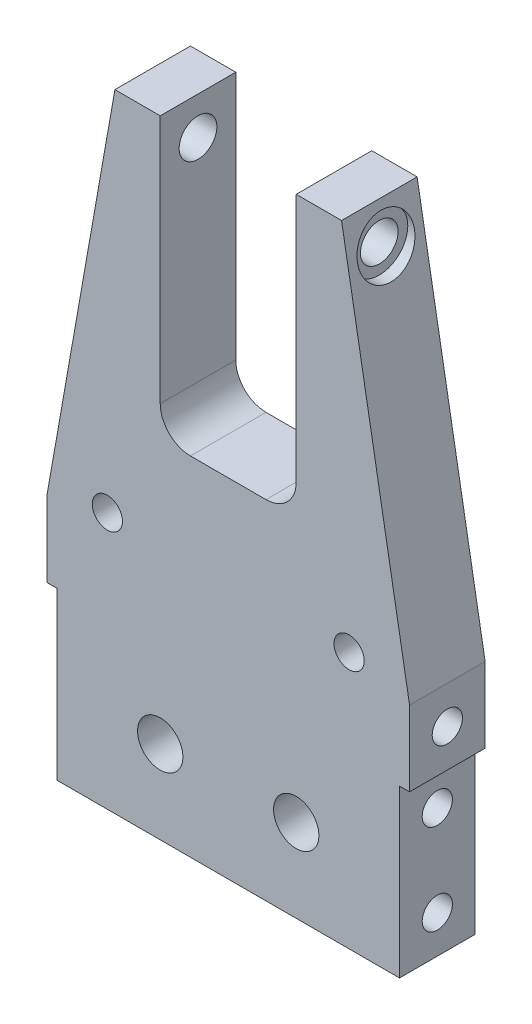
ISO-10303-21;
HEADER;
FILE_DESCRIPTION(('STEP AP214'),'2;1');
FILE_NAME('part.step','',(''),(''),'','','');
FILE_SCHEMA(('AUTOMOTIVE_DESIGN { 1 0 10303 214 1 1 1 1 }'));
ENDSEC;
DATA;
#1=APPLICATION_CONTEXT('core data for automotive mechanical design processes');
#2=APPLICATION_PROTOCOL_DEFINITION('international standard','automotive_design',2000,#1);
#3=PRODUCT_CONTEXT('',#1,'mechanical');
#4=PRODUCT('Part','Part','',(#3));
#5=PRODUCT_RELATED_PRODUCT_CATEGORY('part','',(#4));
#6=PRODUCT_DEFINITION_FORMATION('','',#4);
#7=PRODUCT_DEFINITION_CONTEXT('part definition',#1,'design');
#8=PRODUCT_DEFINITION('design','',#6,#7);
#9=PRODUCT_DEFINITION_SHAPE('','',#8);
#10=(LENGTH_UNIT() NAMED_UNIT(*) SI_UNIT(.MILLI.,.METRE.));
#11=(NAMED_UNIT(*) PLANE_ANGLE_UNIT() SI_UNIT($,.RADIAN.));
#12=(NAMED_UNIT(*) SI_UNIT($,.STERADIAN.) SOLID_ANGLE_UNIT());
#13=UNCERTAINTY_MEASURE_WITH_UNIT(LENGTH_MEASURE(1.E-05),#10,'distance_accuracy_value','');
#14=(GEOMETRIC_REPRESENTATION_CONTEXT(3) GLOBAL_UNCERTAINTY_ASSIGNED_CONTEXT((#13)) GLOBAL_UNIT_ASSIGNED_CONTEXT((#10,
#11,#12)) REPRESENTATION_CONTEXT('',''));
#15=CARTESIAN_POINT('',(0.,0.,0.));
#16=DIRECTION('',(0.,0.,1.));
#17=DIRECTION('',(1.,0.,0.));
#18=AXIS2_PLACEMENT_3D('',#15,#16,#17);
#19=CARTESIAN_POINT('',(38.1,34.925,7.9375));
#20=DIRECTION('',(-1.,0.,0.));
#21=DIRECTION('',(0.,0.,1.));
#22=AXIS2_PLACEMENT_3D('',#19,#20,#21);
#23=PLANE('',#22);
#24=DIRECTION('',(0.,1.,0.));
#25=VECTOR('',#24,1.);
#26=CARTESIAN_POINT('',(38.1,34.925,-7.9375));
#27=LINE('',#26,#25);
#28=CARTESIAN_POINT('',(38.1,34.925,-7.9375));
#29=VERTEX_POINT('',#28);
#30=CARTESIAN_POINT('',(38.1,50.7213610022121,-7.9375));
#31=VERTEX_POINT('',#30);
#32=EDGE_CURVE('E477',#29,#31,#27,.T.);
#33=ORIENTED_EDGE('',*,*,#32,.T.);
#34=DIRECTION('',(0.,0.,-1.));
#35=VECTOR('',#34,1.);
#36=CARTESIAN_POINT('',(38.1,50.7213610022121,7.9375));
#37=LINE('',#36,#35);
#38=CARTESIAN_POINT('',(38.1,50.7213610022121,7.9375));
#39=VERTEX_POINT('',#38);
#40=EDGE_CURVE('E461',#39,#31,#37,.T.);
#41=ORIENTED_EDGE('',*,*,#40,.F.);
#42=DIRECTION('',(0.,1.,0.));
#43=VECTOR('',#42,1.);
#44=CARTESIAN_POINT('',(38.1,34.925,7.9375));
#45=LINE('',#44,#43);
#46=CARTESIAN_POINT('',(38.1,34.925,7.9375));
#47=VERTEX_POINT('',#46);
#48=EDGE_CURVE('E489',#47,#39,#45,.T.);
#49=ORIENTED_EDGE('',*,*,#48,.F.);
#50=DIRECTION('',(0.,0.,-1.));
#51=VECTOR('',#50,1.);
#52=CARTESIAN_POINT('',(38.1,34.925,7.9375));
#53=LINE('',#52,#51);
#54=EDGE_CURVE('E464',#47,#29,#53,.T.);
#55=ORIENTED_EDGE('',*,*,#54,.T.);
#56=EDGE_LOOP('',(#33,#41,#49,#55));
#57=FACE_BOUND('',#56,.T.);
#58=CARTESIAN_POINT('',(38.1,42.8498,0.));
#59=DIRECTION('',(-1.,0.,0.));
#60=DIRECTION('',(0.,0.,1.));
#61=AXIS2_PLACEMENT_3D('',#58,#59,#60);
#62=CIRCLE('',#61,3.175);
#63=CARTESIAN_POINT('',(38.1,42.8498,3.175));
#64=VERTEX_POINT('',#63);
#65=EDGE_CURVE('E207',#64,#64,#62,.F.);
#66=ORIENTED_EDGE('',*,*,#65,.F.);
#67=EDGE_LOOP('',(#66));
#68=FACE_BOUND('',#67,.T.);
#69=ADVANCED_FACE('F33',(#57,#68),#23,.F.);
#70=CARTESIAN_POINT('',(35.9918,0.,7.9375));
#71=DIRECTION('',(-1.,0.,0.));
#72=DIRECTION('',(0.,0.,1.));
#73=AXIS2_PLACEMENT_3D('',#70,#71,#72);
#74=PLANE('',#73);
#75=CARTESIAN_POINT('',(35.9918,7.9248,0.));
#76=DIRECTION('',(-1.,0.,0.));
#77=DIRECTION('',(0.,0.,1.));
#78=AXIS2_PLACEMENT_3D('',#75,#76,#77);
#79=CIRCLE('',#78,3.175);
#80=CARTESIAN_POINT('',(35.9918,7.9248,3.175));
#81=VERTEX_POINT('',#80);
#82=EDGE_CURVE('E195',#81,#81,#79,.F.);
#83=ORIENTED_EDGE('',*,*,#82,.F.);
#84=EDGE_LOOP('',(#83));
#85=FACE_BOUND('',#84,.T.);
#86=DIRECTION('',(0.,1.,0.));
#87=VECTOR('',#86,1.);
#88=CARTESIAN_POINT('',(35.9918,0.,-7.9375));
#89=LINE('',#88,#87);
#90=CARTESIAN_POINT('',(35.9918,0.,-7.9375));
#91=VERTEX_POINT('',#90);
#92=CARTESIAN_POINT('',(35.9918,34.925,-7.9375));
#93=VERTEX_POINT('',#92);
#94=EDGE_CURVE('E476',#91,#93,#89,.T.);
#95=ORIENTED_EDGE('',*,*,#94,.T.);
#96=DIRECTION('',(0.,0.,-1.));
#97=VECTOR('',#96,1.);
#98=CARTESIAN_POINT('',(35.9918,34.925,7.9375));
#99=LINE('',#98,#97);
#100=CARTESIAN_POINT('',(35.9918,34.925,7.9375));
#101=VERTEX_POINT('',#100);
#102=EDGE_CURVE('E176',#101,#93,#99,.T.);
#103=ORIENTED_EDGE('',*,*,#102,.F.);
#104=DIRECTION('',(0.,1.,0.));
#105=VECTOR('',#104,1.);
#106=CARTESIAN_POINT('',(35.9918,0.,7.9375));
#107=LINE('',#106,#105);
#108=CARTESIAN_POINT('',(35.9918,0.,7.9375));
#109=VERTEX_POINT('',#108);
#110=EDGE_CURVE('E157',#109,#101,#107,.T.);
#111=ORIENTED_EDGE('',*,*,#110,.F.);
#112=DIRECTION('',(0.,0.,-1.));
#113=VECTOR('',#112,1.);
#114=CARTESIAN_POINT('',(35.9918,0.,7.9375));
#115=LINE('',#114,#113);
#116=EDGE_CURVE('E155',#109,#91,#115,.T.);
#117=ORIENTED_EDGE('',*,*,#116,.T.);
#118=EDGE_LOOP('',(#95,#103,#111,#117));
#119=FACE_BOUND('',#118,.T.);
#120=CARTESIAN_POINT('',(35.9918,26.9748,0.));
#121=DIRECTION('',(-1.,0.,0.));
#122=DIRECTION('',(0.,0.,1.));
#123=AXIS2_PLACEMENT_3D('',#120,#121,#122);
#124=CIRCLE('',#123,3.175);
#125=CARTESIAN_POINT('',(35.9918,26.9748,3.175));
#126=VERTEX_POINT('',#125);
#127=EDGE_CURVE('E198',#126,#126,#124,.F.);
#128=ORIENTED_EDGE('',*,*,#127,.F.);
#129=EDGE_LOOP('',(#128));
#130=FACE_BOUND('',#129,.T.);
#131=ADVANCED_FACE('F275',(#85,#119,#130),#74,.F.);
#132=CARTESIAN_POINT('',(38.1,50.7213610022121,7.9375));
#133=DIRECTION('',(-0.984807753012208,-0.173648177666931,0.));
#134=DIRECTION('',(0.173648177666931,-0.984807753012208,0.));
#135=AXIS2_PLACEMENT_3D('',#132,#133,#134);
#136=PLANE('',#135);
#137=DIRECTION('',(-0.173648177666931,0.984807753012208,0.));
#138=VECTOR('',#137,1.);
#139=CARTESIAN_POINT('',(38.1,50.7213610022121,-7.9375));
#140=LINE('',#139,#138);
#141=CARTESIAN_POINT('',(23.8125,131.7498,-7.9375));
#142=VERTEX_POINT('',#141);
#143=EDGE_CURVE('E422',#31,#142,#140,.T.);
#144=ORIENTED_EDGE('',*,*,#143,.T.);
#145=DIRECTION('',(0.,0.,-1.));
#146=VECTOR('',#145,1.);
#147=CARTESIAN_POINT('',(23.8125,131.7498,7.9375));
#148=LINE('',#147,#146);
#149=CARTESIAN_POINT('',(23.8125,131.7498,7.9375));
#150=VERTEX_POINT('',#149);
#151=EDGE_CURVE('E417',#150,#142,#148,.T.);
#152=ORIENTED_EDGE('',*,*,#151,.F.);
#153=DIRECTION('',(-0.173648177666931,0.984807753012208,0.));
#154=VECTOR('',#153,1.);
#155=CARTESIAN_POINT('',(38.1,50.7213610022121,7.9375));
#156=LINE('',#155,#154);
#157=EDGE_CURVE('E487',#39,#150,#156,.T.);
#158=ORIENTED_EDGE('',*,*,#157,.F.);
#159=ORIENTED_EDGE('',*,*,#40,.T.);
#160=EDGE_LOOP('',(#144,#152,#158,#159));
#161=FACE_BOUND('',#160,.T.);
#162=CARTESIAN_POINT('',(25.2098560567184,123.825,0.));
#163=DIRECTION('',(-0.984807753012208,-0.173648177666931,0.));
#164=DIRECTION('',(-0.173648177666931,0.984807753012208,0.));
#165=AXIS2_PLACEMENT_3D('',#162,#163,#164);
#166=ELLIPSE('',#165,6.08687328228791,5.9944);
#167=CARTESIAN_POINT('',(24.1528816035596,129.8194,0.));
#168=VERTEX_POINT('',#167);
#169=EDGE_CURVE('E191',#168,#168,#166,.F.);
#170=ORIENTED_EDGE('',*,*,#169,.F.);
#171=EDGE_LOOP('',(#170));
#172=FACE_BOUND('',#171,.T.);
#173=ADVANCED_FACE('F281',(#161,#172),#136,.F.);
#174=CARTESIAN_POINT('',(-38.1,123.825,0.));
#175=DIRECTION('',(1.,0.,0.));
#176=DIRECTION('',(0.,0.,-1.));
#177=AXIS2_PLACEMENT_3D('',#174,#175,#176);
#178=CYLINDRICAL_SURFACE('',#177,3.96239999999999);
#179=CARTESIAN_POINT('',(14.2875,123.825,0.));
#180=DIRECTION('',(1.,0.,0.));
#181=DIRECTION('',(0.,1.,0.));
#182=AXIS2_PLACEMENT_3D('',#179,#180,#181);
#183=CIRCLE('',#182,3.96239999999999);
#184=CARTESIAN_POINT('',(14.2875,123.825,-3.96239999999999));
#185=VERTEX_POINT('',#184);
#186=EDGE_CURVE('E509',#185,#185,#183,.T.);
#187=CARTESIAN_POINT('',(23.7998,123.825,0.));
#188=DIRECTION('',(1.,0.,0.));
#189=DIRECTION('',(0.,0.,-1.));
#190=AXIS2_PLACEMENT_3D('',#187,#188,#189);
#191=CIRCLE('',#190,3.96239999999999);
#192=CARTESIAN_POINT('',(23.7998,123.825,-3.96239999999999));
#193=VERTEX_POINT('',#192);
#194=EDGE_CURVE('E188',#193,#193,#191,.F.);
#195=CARTESIAN_POINT('',(14.2875,123.825,-3.96239999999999));
#196=CARTESIAN_POINT('',(14.3865864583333,123.825,-3.96239999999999));
#197=CARTESIAN_POINT('',(14.4856729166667,123.825,-3.96239999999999));
#198=CARTESIAN_POINT('',(14.6838458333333,123.825,-3.96239999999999));
#199=CARTESIAN_POINT('',(14.7829322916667,123.825,-3.96239999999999));
#200=CARTESIAN_POINT('',(14.9811052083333,123.825,-3.96239999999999));
#201=CARTESIAN_POINT('',(15.0801916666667,123.825,-3.96239999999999));
#202=CARTESIAN_POINT('',(15.2783645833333,123.825,-3.96239999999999));
#203=CARTESIAN_POINT('',(15.3774510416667,123.825,-3.96239999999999));
#204=CARTESIAN_POINT('',(15.5756239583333,123.825,-3.96239999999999));
#205=CARTESIAN_POINT('',(15.6747104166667,123.825,-3.96239999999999));
#206=CARTESIAN_POINT('',(15.8728833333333,123.825,-3.96239999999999));
#207=CARTESIAN_POINT('',(15.9719697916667,123.825,-3.96239999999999));
#208=CARTESIAN_POINT('',(16.1701427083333,123.825,-3.96239999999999));
#209=CARTESIAN_POINT('',(16.2692291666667,123.825,-3.96239999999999));
#210=CARTESIAN_POINT('',(16.4674020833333,123.825,-3.96239999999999));
#211=CARTESIAN_POINT('',(16.5664885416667,123.825,-3.96239999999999));
#212=CARTESIAN_POINT('',(16.7646614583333,123.825,-3.96239999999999));
#213=CARTESIAN_POINT('',(16.8637479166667,123.825,-3.96239999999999));
#214=CARTESIAN_POINT('',(17.0619208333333,123.825,-3.96239999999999));
#215=CARTESIAN_POINT('',(17.1610072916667,123.825,-3.96239999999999));
#216=CARTESIAN_POINT('',(17.3591802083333,123.825,-3.96239999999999));
#217=CARTESIAN_POINT('',(17.4582666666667,123.825,-3.96239999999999));
#218=CARTESIAN_POINT('',(17.6564395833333,123.825,-3.96239999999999));
#219=CARTESIAN_POINT('',(17.7555260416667,123.825,-3.96239999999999));
#220=CARTESIAN_POINT('',(17.9536989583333,123.825,-3.96239999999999));
#221=CARTESIAN_POINT('',(18.0527854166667,123.825,-3.96239999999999));
#222=CARTESIAN_POINT('',(18.2509583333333,123.825,-3.96239999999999));
#223=CARTESIAN_POINT('',(18.3500447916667,123.825,-3.96239999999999));
#224=CARTESIAN_POINT('',(18.5482177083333,123.825,-3.96239999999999));
#225=CARTESIAN_POINT('',(18.6473041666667,123.825,-3.96239999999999));
#226=CARTESIAN_POINT('',(18.8454770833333,123.825,-3.96239999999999));
#227=CARTESIAN_POINT('',(18.9445635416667,123.825,-3.96239999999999));
#228=CARTESIAN_POINT('',(19.1427364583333,123.825,-3.96239999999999));
#229=CARTESIAN_POINT('',(19.2418229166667,123.825,-3.96239999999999));
#230=CARTESIAN_POINT('',(19.4399958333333,123.825,-3.96239999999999));
#231=CARTESIAN_POINT('',(19.5390822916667,123.825,-3.96239999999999));
#232=CARTESIAN_POINT('',(19.7372552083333,123.825,-3.96239999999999));
#233=CARTESIAN_POINT('',(19.8363416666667,123.825,-3.96239999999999));
#234=CARTESIAN_POINT('',(20.0345145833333,123.825,-3.96239999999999));
#235=CARTESIAN_POINT('',(20.1336010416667,123.825,-3.96239999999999));
#236=CARTESIAN_POINT('',(20.3317739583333,123.825,-3.96239999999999));
#237=CARTESIAN_POINT('',(20.4308604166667,123.825,-3.96239999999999));
#238=CARTESIAN_POINT('',(20.6290333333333,123.825,-3.96239999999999));
#239=CARTESIAN_POINT('',(20.7281197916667,123.825,-3.96239999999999));
#240=CARTESIAN_POINT('',(20.9262927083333,123.825,-3.96239999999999));
#241=CARTESIAN_POINT('',(21.0253791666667,123.825,-3.96239999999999));
#242=CARTESIAN_POINT('',(21.2235520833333,123.825,-3.96239999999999));
#243=CARTESIAN_POINT('',(21.3226385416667,123.825,-3.96239999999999));
#244=CARTESIAN_POINT('',(21.5208114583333,123.825,-3.96239999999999));
#245=CARTESIAN_POINT('',(21.6198979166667,123.825,-3.96239999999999));
#246=CARTESIAN_POINT('',(21.8180708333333,123.825,-3.96239999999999));
#247=CARTESIAN_POINT('',(21.9171572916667,123.825,-3.96239999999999));
#248=CARTESIAN_POINT('',(22.1153302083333,123.825,-3.96239999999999));
#249=CARTESIAN_POINT('',(22.2144166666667,123.825,-3.96239999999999));
#250=CARTESIAN_POINT('',(22.4125895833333,123.825,-3.96239999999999));
#251=CARTESIAN_POINT('',(22.5116760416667,123.825,-3.96239999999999));
#252=CARTESIAN_POINT('',(22.7098489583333,123.825,-3.96239999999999));
#253=CARTESIAN_POINT('',(22.8089354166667,123.825,-3.96239999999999));
#254=CARTESIAN_POINT('',(23.0071083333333,123.825,-3.96239999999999));
#255=CARTESIAN_POINT('',(23.1061947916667,123.825,-3.96239999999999));
#256=CARTESIAN_POINT('',(23.3043677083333,123.825,-3.96239999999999));
#257=CARTESIAN_POINT('',(23.4034541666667,123.825,-3.96239999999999));
#258=CARTESIAN_POINT('',(23.6016270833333,123.825,-3.96239999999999));
#259=CARTESIAN_POINT('',(23.7007135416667,123.825,-3.96239999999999));
#260=CARTESIAN_POINT('',(23.7998,123.825,-3.96239999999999));
#261=B_SPLINE_CURVE_WITH_KNOTS('',3,(#195,#196,#197,#198,#199,#200,#201,#202,#203,#204,#205,
#206,#207,#208,#209,#210,#211,#212,#213,#214,#215,#216,#217,#218,#219,#220,#221,#222,#223,#224,
#225,#226,#227,#228,#229,#230,#231,#232,#233,#234,#235,#236,#237,#238,#239,#240,#241,#242,#243,
#244,#245,#246,#247,#248,#249,#250,#251,#252,#253,#254,#255,#256,#257,#258,#259,#260),
.UNSPECIFIED.,.F.,.F.,(4,2,2,2,2,2,2,2,2,2,2,2,2,2,2,2,2,2,2,2,2,2,2,2,2,2,2,2,2,2,2,2,4),(0.,
0.297259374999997,0.594518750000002,0.891778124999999,1.1890375,1.486296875,1.78355625,
2.080815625,2.378075,2.675334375,2.97259375,3.269853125,3.5671125,3.864371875,4.16163125,
4.458890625,4.75615,5.053409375,5.35066875,5.647928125,5.9451875,6.242446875,6.53970625,
6.836965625,7.134225,7.431484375,7.72874375,8.026003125,8.3232625,8.620521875,8.91778125,
9.215040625,9.5123),.UNSPECIFIED.);
#262=EDGE_CURVE('BSEAM297',#185,#193,#261,.T.);
#263=ORIENTED_EDGE('',*,*,#186,.F.);
#264=ORIENTED_EDGE('',*,*,#194,.F.);
#265=ORIENTED_EDGE('',*,*,#262,.T.);
#266=ORIENTED_EDGE('',*,*,#262,.F.);
#267=EDGE_LOOP('',(#263,#265,#264,#266));
#268=FACE_BOUND('',#267,.T.);
#269=ADVANCED_FACE('F297',(#268),#178,.F.);
#270=CARTESIAN_POINT('',(-35.9918,34.925,7.9375));
#271=DIRECTION('',(1.,0.,0.));
#272=DIRECTION('',(0.,0.,-1.));
#273=AXIS2_PLACEMENT_3D('',#270,#271,#272);
#274=PLANE('',#273);
#275=CARTESIAN_POINT('',(-35.9918,26.9748,0.));
#276=DIRECTION('',(1.,0.,0.));
#277=DIRECTION('',(0.,0.,-1.));
#278=AXIS2_PLACEMENT_3D('',#275,#276,#277);
#279=CIRCLE('',#278,3.175);
#280=CARTESIAN_POINT('',(-35.9918,26.9748,-3.175));
#281=VERTEX_POINT('',#280);
#282=EDGE_CURVE('E204',#281,#281,#279,.T.);
#283=ORIENTED_EDGE('',*,*,#282,.T.);
#284=EDGE_LOOP('',(#283));
#285=FACE_BOUND('',#284,.T.);
#286=CARTESIAN_POINT('',(-35.9918,7.9248,0.));
#287=DIRECTION('',(1.,0.,0.));
#288=DIRECTION('',(0.,0.,-1.));
#289=AXIS2_PLACEMENT_3D('',#286,#287,#288);
#290=CIRCLE('',#289,3.175);
#291=CARTESIAN_POINT('',(-35.9918,7.9248,-3.175));
#292=VERTEX_POINT('',#291);
#293=EDGE_CURVE('E201',#292,#292,#290,.T.);
#294=ORIENTED_EDGE('',*,*,#293,.T.);
#295=EDGE_LOOP('',(#294));
#296=FACE_BOUND('',#295,.T.);
#297=DIRECTION('',(0.,-1.,0.));
#298=VECTOR('',#297,1.);
#299=CARTESIAN_POINT('',(-35.9918,34.925,-7.9375));
#300=LINE('',#299,#298);
#301=CARTESIAN_POINT('',(-35.9918,34.925,-7.9375));
#302=VERTEX_POINT('',#301);
#303=CARTESIAN_POINT('',(-35.9918,0.,-7.9375));
#304=VERTEX_POINT('',#303);
#305=EDGE_CURVE('E171',#302,#304,#300,.T.);
#306=ORIENTED_EDGE('',*,*,#305,.T.);
#307=DIRECTION('',(0.,0.,-1.));
#308=VECTOR('',#307,1.);
#309=CARTESIAN_POINT('',(-35.9918,0.,7.9375));
#310=LINE('',#309,#308);
#311=CARTESIAN_POINT('',(-35.9918,0.,7.9375));
#312=VERTEX_POINT('',#311);
#313=EDGE_CURVE('E152',#312,#304,#310,.T.);
#314=ORIENTED_EDGE('',*,*,#313,.F.);
#315=DIRECTION('',(0.,-1.,0.));
#316=VECTOR('',#315,1.);
#317=CARTESIAN_POINT('',(-35.9918,34.925,7.9375));
#318=LINE('',#317,#316);
#319=CARTESIAN_POINT('',(-35.9918,34.925,7.9375));
#320=VERTEX_POINT('',#319);
#321=EDGE_CURVE('E158',#320,#312,#318,.T.);
#322=ORIENTED_EDGE('',*,*,#321,.F.);
#323=DIRECTION('',(0.,0.,-1.));
#324=VECTOR('',#323,1.);
#325=CARTESIAN_POINT('',(-35.9918,34.925,7.9375));
#326=LINE('',#325,#324);
#327=EDGE_CURVE('E447',#320,#302,#326,.T.);
#328=ORIENTED_EDGE('',*,*,#327,.T.);
#329=EDGE_LOOP('',(#306,#314,#322,#328));
#330=FACE_BOUND('',#329,.T.);
#331=ADVANCED_FACE('F169',(#285,#296,#330),#274,.F.);
#332=CARTESIAN_POINT('',(0.,0.,7.9375));
#333=DIRECTION('',(0.,1.,0.));
#334=DIRECTION('',(0.,0.,1.));
#335=AXIS2_PLACEMENT_3D('',#332,#333,#334);
#336=PLANE('',#335);
#337=DIRECTION('',(1.,0.,0.));
#338=VECTOR('',#337,1.);
#339=CARTESIAN_POINT('',(0.,0.,-7.9375));
#340=LINE('',#339,#338);
#341=EDGE_CURVE('E480',#304,#91,#340,.T.);
#342=ORIENTED_EDGE('',*,*,#341,.T.);
#343=ORIENTED_EDGE('',*,*,#116,.F.);
#344=DIRECTION('',(1.,0.,0.));
#345=VECTOR('',#344,1.);
#346=CARTESIAN_POINT('',(-35.9918,0.,7.9375));
#347=LINE('',#346,#345);
#348=EDGE_CURVE('E148',#312,#109,#347,.T.);
#349=ORIENTED_EDGE('',*,*,#348,.F.);
#350=ORIENTED_EDGE('',*,*,#313,.T.);
#351=EDGE_LOOP('',(#342,#343,#349,#350));
#352=FACE_BOUND('',#351,.T.);
#353=ADVANCED_FACE('F150',(#352),#336,.F.);
#354=CARTESIAN_POINT('',(35.9918,34.925,7.9375));
#355=DIRECTION('',(0.,1.,0.));
#356=DIRECTION('',(0.,0.,1.));
#357=AXIS2_PLACEMENT_3D('',#354,#355,#356);
#358=PLANE('',#357);
#359=DIRECTION('',(1.,0.,0.));
#360=VECTOR('',#359,1.);
#361=CARTESIAN_POINT('',(35.9918,34.925,-7.9375));
#362=LINE('',#361,#360);
#363=EDGE_CURVE('E471',#93,#29,#362,.T.);
#364=ORIENTED_EDGE('',*,*,#363,.T.);
#365=ORIENTED_EDGE('',*,*,#54,.F.);
#366=DIRECTION('',(1.,0.,0.));
#367=VECTOR('',#366,1.);
#368=CARTESIAN_POINT('',(35.9918,34.925,7.9375));
#369=LINE('',#368,#367);
#370=EDGE_CURVE('E472',#101,#47,#369,.T.);
#371=ORIENTED_EDGE('',*,*,#370,.F.);
#372=ORIENTED_EDGE('',*,*,#102,.T.);
#373=EDGE_LOOP('',(#364,#365,#371,#372));
#374=FACE_BOUND('',#373,.T.);
#375=ADVANCED_FACE('F288',(#374),#358,.F.);
#376=CARTESIAN_POINT('',(23.8125,131.7498,7.9375));
#377=DIRECTION('',(0.,-1.,0.));
#378=DIRECTION('',(0.,0.,-1.));
#379=AXIS2_PLACEMENT_3D('',#376,#377,#378);
#380=PLANE('',#379);
#381=DIRECTION('',(-1.,0.,0.));
#382=VECTOR('',#381,1.);
#383=CARTESIAN_POINT('',(23.8125,131.7498,-7.9375));
#384=LINE('',#383,#382);
#385=CARTESIAN_POINT('',(14.2875,131.7498,-7.9375));
#386=VERTEX_POINT('',#385);
#387=EDGE_CURVE('E411',#142,#386,#384,.T.);
#388=ORIENTED_EDGE('',*,*,#387,.T.);
#389=DIRECTION('',(0.,0.,-1.));
#390=VECTOR('',#389,1.);
#391=CARTESIAN_POINT('',(14.2875,131.7498,7.9375));
#392=LINE('',#391,#390);
#393=CARTESIAN_POINT('',(14.2875,131.7498,7.9375));
#394=VERTEX_POINT('',#393);
#395=EDGE_CURVE('E414',#394,#386,#392,.T.);
#396=ORIENTED_EDGE('',*,*,#395,.F.);
#397=DIRECTION('',(-1.,0.,0.));
#398=VECTOR('',#397,1.);
#399=CARTESIAN_POINT('',(23.8125,131.7498,7.9375));
#400=LINE('',#399,#398);
#401=EDGE_CURVE('E491',#150,#394,#400,.T.);
#402=ORIENTED_EDGE('',*,*,#401,.F.);
#403=ORIENTED_EDGE('',*,*,#151,.T.);
#404=EDGE_LOOP('',(#388,#396,#402,#403));
#405=FACE_BOUND('',#404,.T.);
#406=ADVANCED_FACE('F290',(#405),#380,.F.);
#407=CARTESIAN_POINT('',(14.2875,131.7498,7.9375));
#408=DIRECTION('',(1.,0.,0.));
#409=DIRECTION('',(0.,1.,0.));
#410=AXIS2_PLACEMENT_3D('',#407,#408,#409);
#411=PLANE('',#410);
#412=ORIENTED_EDGE('',*,*,#186,.T.);
#413=EDGE_LOOP('',(#412));
#414=FACE_BOUND('',#413,.T.);
#415=DIRECTION('',(0.,-1.,0.));
#416=VECTOR('',#415,1.);
#417=CARTESIAN_POINT('',(14.2875,131.7498,-7.9375));
#418=LINE('',#417,#416);
#419=CARTESIAN_POINT('',(14.2875,79.375,-7.9375));
#420=VERTEX_POINT('',#419);
#421=EDGE_CURVE('E421',#386,#420,#418,.T.);
#422=ORIENTED_EDGE('',*,*,#421,.T.);
#423=DIRECTION('',(0.,0.,-1.));
#424=VECTOR('',#423,1.);
#425=CARTESIAN_POINT('',(14.2875,79.375,7.9375));
#426=LINE('',#425,#424);
#427=CARTESIAN_POINT('',(14.2875,79.375,7.9375));
#428=VERTEX_POINT('',#427);
#429=EDGE_CURVE('E217',#420,#428,#426,.F.);
#430=ORIENTED_EDGE('',*,*,#429,.T.);
#431=DIRECTION('',(0.,-1.,0.));
#432=VECTOR('',#431,1.);
#433=CARTESIAN_POINT('',(14.2875,131.7498,7.9375));
#434=LINE('',#433,#432);
#435=EDGE_CURVE('E428',#394,#428,#434,.T.);
#436=ORIENTED_EDGE('',*,*,#435,.F.);
#437=ORIENTED_EDGE('',*,*,#395,.T.);
#438=EDGE_LOOP('',(#422,#430,#436,#437));
#439=FACE_BOUND('',#438,.T.);
#440=ADVANCED_FACE('F400',(#414,#439),#411,.F.);
#441=CARTESIAN_POINT('',(14.2875,73.025,7.9375));
#442=DIRECTION('',(0.,-1.,0.));
#443=DIRECTION('',(0.,0.,-1.));
#444=AXIS2_PLACEMENT_3D('',#441,#442,#443);
#445=PLANE('',#444);
#446=DIRECTION('',(-1.,0.,0.));
#447=VECTOR('',#446,1.);
#448=CARTESIAN_POINT('',(14.2875,73.025,7.9375));
#449=LINE('',#448,#447);
#450=CARTESIAN_POINT('',(7.93750000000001,73.025,7.9375));
#451=VERTEX_POINT('',#450);
#452=CARTESIAN_POINT('',(-7.93750000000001,73.025,7.9375));
#453=VERTEX_POINT('',#452);
#454=EDGE_CURVE('E498',#451,#453,#449,.T.);
#455=ORIENTED_EDGE('',*,*,#454,.F.);
#456=DIRECTION('',(0.,0.,-1.));
#457=VECTOR('',#456,1.);
#458=CARTESIAN_POINT('',(7.93750000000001,73.025,-7.9375));
#459=LINE('',#458,#457);
#460=CARTESIAN_POINT('',(7.93750000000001,73.025,-7.9375));
#461=VERTEX_POINT('',#460);
#462=EDGE_CURVE('E174',#451,#461,#459,.T.);
#463=ORIENTED_EDGE('',*,*,#462,.T.);
#464=DIRECTION('',(-1.,0.,0.));
#465=VECTOR('',#464,1.);
#466=CARTESIAN_POINT('',(14.2875,73.025,-7.9375));
#467=LINE('',#466,#465);
#468=CARTESIAN_POINT('',(-7.93750000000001,73.025,-7.9375));
#469=VERTEX_POINT('',#468);
#470=EDGE_CURVE('E432',#461,#469,#467,.T.);
#471=ORIENTED_EDGE('',*,*,#470,.T.);
#472=DIRECTION('',(0.,0.,-1.));
#473=VECTOR('',#472,1.);
#474=CARTESIAN_POINT('',(-7.93750000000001,73.025,7.9375));
#475=LINE('',#474,#473);
#476=EDGE_CURVE('E172',#469,#453,#475,.F.);
#477=ORIENTED_EDGE('',*,*,#476,.T.);
#478=EDGE_LOOP('',(#455,#463,#471,#477));
#479=FACE_BOUND('',#478,.T.);
#480=ADVANCED_FACE('F396',(#479),#445,.F.);
#481=CARTESIAN_POINT('',(-14.2875,73.025,7.9375));
#482=DIRECTION('',(-1.,0.,0.));
#483=DIRECTION('',(0.,-1.,0.));
#484=AXIS2_PLACEMENT_3D('',#481,#482,#483);
#485=PLANE('',#484);
#486=CARTESIAN_POINT('',(-14.2875,123.825,0.));
#487=DIRECTION('',(-1.,0.,0.));
#488=DIRECTION('',(0.,-1.,0.));
#489=AXIS2_PLACEMENT_3D('',#486,#487,#488);
#490=CIRCLE('',#489,3.96239999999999);
#491=CARTESIAN_POINT('',(-14.2875,123.825,-3.96239999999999));
#492=VERTEX_POINT('',#491);
#493=EDGE_CURVE('E187',#492,#492,#490,.T.);
#494=ORIENTED_EDGE('',*,*,#493,.T.);
#495=EDGE_LOOP('',(#494));
#496=FACE_BOUND('',#495,.T.);
#497=DIRECTION('',(0.,1.,0.));
#498=VECTOR('',#497,1.);
#499=CARTESIAN_POINT('',(-14.2875,73.025,7.9375));
#500=LINE('',#499,#498);
#501=CARTESIAN_POINT('',(-14.2875,79.375,7.9375));
#502=VERTEX_POINT('',#501);
#503=CARTESIAN_POINT('',(-14.2875,131.7498,7.9375));
#504=VERTEX_POINT('',#503);
#505=EDGE_CURVE('E500',#502,#504,#500,.T.);
#506=ORIENTED_EDGE('',*,*,#505,.F.);
#507=DIRECTION('',(0.,0.,-1.));
#508=VECTOR('',#507,1.);
#509=CARTESIAN_POINT('',(-14.2875,79.375,-7.9375));
#510=LINE('',#509,#508);
#511=CARTESIAN_POINT('',(-14.2875,79.375,-7.9375));
#512=VERTEX_POINT('',#511);
#513=EDGE_CURVE('E219',#502,#512,#510,.T.);
#514=ORIENTED_EDGE('',*,*,#513,.T.);
#515=DIRECTION('',(0.,1.,0.));
#516=VECTOR('',#515,1.);
#517=CARTESIAN_POINT('',(-14.2875,73.025,-7.9375));
#518=LINE('',#517,#516);
#519=CARTESIAN_POINT('',(-14.2875,131.7498,-7.9375));
#520=VERTEX_POINT('',#519);
#521=EDGE_CURVE('E435',#512,#520,#518,.T.);
#522=ORIENTED_EDGE('',*,*,#521,.T.);
#523=DIRECTION('',(0.,0.,-1.));
#524=VECTOR('',#523,1.);
#525=CARTESIAN_POINT('',(-14.2875,131.7498,7.9375));
#526=LINE('',#525,#524);
#527=EDGE_CURVE('E429',#504,#520,#526,.T.);
#528=ORIENTED_EDGE('',*,*,#527,.F.);
#529=EDGE_LOOP('',(#506,#514,#522,#528));
#530=FACE_BOUND('',#529,.T.);
#531=ADVANCED_FACE('F392',(#496,#530),#485,.F.);
#532=CARTESIAN_POINT('',(-14.2875,131.7498,7.9375));
#533=DIRECTION('',(0.,-1.,0.));
#534=DIRECTION('',(0.,0.,-1.));
#535=AXIS2_PLACEMENT_3D('',#532,#533,#534);
#536=PLANE('',#535);
#537=DIRECTION('',(-1.,0.,0.));
#538=VECTOR('',#537,1.);
#539=CARTESIAN_POINT('',(-14.2875,131.7498,-7.9375));
#540=LINE('',#539,#538);
#541=CARTESIAN_POINT('',(-23.8125,131.7498,-7.9375));
#542=VERTEX_POINT('',#541);
#543=EDGE_CURVE('E440',#520,#542,#540,.T.);
#544=ORIENTED_EDGE('',*,*,#543,.T.);
#545=DIRECTION('',(0.,0.,-1.));
#546=VECTOR('',#545,1.);
#547=CARTESIAN_POINT('',(-23.8125,131.7498,7.9375));
#548=LINE('',#547,#546);
#549=CARTESIAN_POINT('',(-23.8125,131.7498,7.9375));
#550=VERTEX_POINT('',#549);
#551=EDGE_CURVE('E455',#550,#542,#548,.T.);
#552=ORIENTED_EDGE('',*,*,#551,.F.);
#553=DIRECTION('',(-1.,0.,0.));
#554=VECTOR('',#553,1.);
#555=CARTESIAN_POINT('',(-14.2875,131.7498,7.9375));
#556=LINE('',#555,#554);
#557=EDGE_CURVE('E502',#504,#550,#556,.T.);
#558=ORIENTED_EDGE('',*,*,#557,.F.);
#559=ORIENTED_EDGE('',*,*,#527,.T.);
#560=EDGE_LOOP('',(#544,#552,#558,#559));
#561=FACE_BOUND('',#560,.T.);
#562=ADVANCED_FACE('F388',(#561),#536,.F.);
#563=CARTESIAN_POINT('',(-38.1,50.7213610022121,7.9375));
#564=DIRECTION('',(0.984807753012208,-0.173648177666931,0.));
#565=DIRECTION('',(0.173648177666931,0.984807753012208,0.));
#566=AXIS2_PLACEMENT_3D('',#563,#564,#565);
#567=PLANE('',#566);
#568=CARTESIAN_POINT('',(-25.2098560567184,123.825,0.));
#569=DIRECTION('',(0.984807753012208,-0.173648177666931,0.));
#570=DIRECTION('',(0.173648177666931,0.984807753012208,0.));
#571=AXIS2_PLACEMENT_3D('',#568,#569,#570);
#572=ELLIPSE('',#571,6.08687328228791,5.9944);
#573=CARTESIAN_POINT('',(-24.1528816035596,129.8194,0.));
#574=VERTEX_POINT('',#573);
#575=EDGE_CURVE('E183',#574,#574,#572,.T.);
#576=ORIENTED_EDGE('',*,*,#575,.T.);
#577=EDGE_LOOP('',(#576));
#578=FACE_BOUND('',#577,.T.);
#579=DIRECTION('',(-0.173648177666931,-0.984807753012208,0.));
#580=VECTOR('',#579,1.);
#581=CARTESIAN_POINT('',(-38.1,50.7213610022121,-7.9375));
#582=LINE('',#581,#580);
#583=CARTESIAN_POINT('',(-38.1,50.7213610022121,-7.9375));
#584=VERTEX_POINT('',#583);
#585=EDGE_CURVE('E442',#542,#584,#582,.T.);
#586=ORIENTED_EDGE('',*,*,#585,.T.);
#587=DIRECTION('',(0.,0.,-1.));
#588=VECTOR('',#587,1.);
#589=CARTESIAN_POINT('',(-38.1,50.7213610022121,7.9375));
#590=LINE('',#589,#588);
#591=CARTESIAN_POINT('',(-38.1,50.7213610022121,7.9375));
#592=VERTEX_POINT('',#591);
#593=EDGE_CURVE('E452',#592,#584,#590,.T.);
#594=ORIENTED_EDGE('',*,*,#593,.F.);
#595=DIRECTION('',(-0.173648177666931,-0.984807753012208,0.));
#596=VECTOR('',#595,1.);
#597=CARTESIAN_POINT('',(-38.1,50.7213610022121,7.9375));
#598=LINE('',#597,#596);
#599=EDGE_CURVE('E504',#550,#592,#598,.T.);
#600=ORIENTED_EDGE('',*,*,#599,.F.);
#601=ORIENTED_EDGE('',*,*,#551,.T.);
#602=EDGE_LOOP('',(#586,#594,#600,#601));
#603=FACE_BOUND('',#602,.T.);
#604=ADVANCED_FACE('F384',(#578,#603),#567,.F.);
#605=CARTESIAN_POINT('',(-38.1,34.925,7.9375));
#606=DIRECTION('',(1.,0.,0.));
#607=DIRECTION('',(0.,0.,-1.));
#608=AXIS2_PLACEMENT_3D('',#605,#606,#607);
#609=PLANE('',#608);
#610=CARTESIAN_POINT('',(-38.1,42.8498,0.));
#611=DIRECTION('',(1.,0.,0.));
#612=DIRECTION('',(0.,0.,-1.));
#613=AXIS2_PLACEMENT_3D('',#610,#611,#612);
#614=CIRCLE('',#613,3.175);
#615=CARTESIAN_POINT('',(-38.1,42.8498,-3.175));
#616=VERTEX_POINT('',#615);
#617=EDGE_CURVE('E211',#616,#616,#614,.T.);
#618=ORIENTED_EDGE('',*,*,#617,.T.);
#619=EDGE_LOOP('',(#618));
#620=FACE_BOUND('',#619,.T.);
#621=DIRECTION('',(0.,-1.,0.));
#622=VECTOR('',#621,1.);
#623=CARTESIAN_POINT('',(-38.1,34.925,-7.9375));
#624=LINE('',#623,#622);
#625=CARTESIAN_POINT('',(-38.1,34.925,-7.9375));
#626=VERTEX_POINT('',#625);
#627=EDGE_CURVE('E444',#584,#626,#624,.T.);
#628=ORIENTED_EDGE('',*,*,#627,.T.);
#629=DIRECTION('',(0.,0.,-1.));
#630=VECTOR('',#629,1.);
#631=CARTESIAN_POINT('',(-38.1,34.925,7.9375));
#632=LINE('',#631,#630);
#633=CARTESIAN_POINT('',(-38.1,34.925,7.9375));
#634=VERTEX_POINT('',#633);
#635=EDGE_CURVE('E449',#634,#626,#632,.T.);
#636=ORIENTED_EDGE('',*,*,#635,.F.);
#637=DIRECTION('',(0.,-1.,0.));
#638=VECTOR('',#637,1.);
#639=CARTESIAN_POINT('',(-38.1,34.925,7.9375));
#640=LINE('',#639,#638);
#641=EDGE_CURVE('E506',#592,#634,#640,.T.);
#642=ORIENTED_EDGE('',*,*,#641,.F.);
#643=ORIENTED_EDGE('',*,*,#593,.T.);
#644=EDGE_LOOP('',(#628,#636,#642,#643));
#645=FACE_BOUND('',#644,.T.);
#646=ADVANCED_FACE('F380',(#620,#645),#609,.F.);
#647=CARTESIAN_POINT('',(-35.9918,34.925,7.9375));
#648=DIRECTION('',(0.,1.,0.));
#649=DIRECTION('',(0.,0.,1.));
#650=AXIS2_PLACEMENT_3D('',#647,#648,#649);
#651=PLANE('',#650);
#652=DIRECTION('',(1.,0.,0.));
#653=VECTOR('',#652,1.);
#654=CARTESIAN_POINT('',(-35.9918,34.925,-7.9375));
#655=LINE('',#654,#653);
#656=EDGE_CURVE('E167',#626,#302,#655,.T.);
#657=ORIENTED_EDGE('',*,*,#656,.T.);
#658=ORIENTED_EDGE('',*,*,#327,.F.);
#659=DIRECTION('',(1.,0.,0.));
#660=VECTOR('',#659,1.);
#661=CARTESIAN_POINT('',(-35.9918,34.925,7.9375));
#662=LINE('',#661,#660);
#663=EDGE_CURVE('E163',#634,#320,#662,.T.);
#664=ORIENTED_EDGE('',*,*,#663,.F.);
#665=ORIENTED_EDGE('',*,*,#635,.T.);
#666=EDGE_LOOP('',(#657,#658,#664,#665));
#667=FACE_BOUND('',#666,.T.);
#668=ADVANCED_FACE('F373',(#667),#651,.F.);
#669=CARTESIAN_POINT('',(0.,0.,7.9375));
#670=DIRECTION('',(0.,0.,1.));
#671=DIRECTION('',(1.,0.,0.));
#672=AXIS2_PLACEMENT_3D('',#669,#670,#671);
#673=PLANE('',#672);
#674=CARTESIAN_POINT('',(14.2875,17.4498,7.9375));
#675=DIRECTION('',(0.,0.,1.));
#676=DIRECTION('',(1.,0.,0.));
#677=AXIS2_PLACEMENT_3D('',#674,#675,#676);
#678=CIRCLE('',#677,4.7625);
#679=CARTESIAN_POINT('',(19.05,17.4498,7.9375));
#680=VERTEX_POINT('',#679);
#681=EDGE_CURVE('E240',#680,#680,#678,.T.);
#682=ORIENTED_EDGE('',*,*,#681,.F.);
#683=EDGE_LOOP('',(#682));
#684=FACE_BOUND('',#683,.T.);
#685=CARTESIAN_POINT('',(-14.2875,17.4498,7.9375));
#686=DIRECTION('',(0.,0.,1.));
#687=DIRECTION('',(1.,0.,0.));
#688=AXIS2_PLACEMENT_3D('',#685,#686,#687);
#689=CIRCLE('',#688,4.7625);
#690=CARTESIAN_POINT('',(-9.525,17.4498,7.9375));
#691=VERTEX_POINT('',#690);
#692=EDGE_CURVE('E236',#691,#691,#689,.T.);
#693=ORIENTED_EDGE('',*,*,#692,.F.);
#694=EDGE_LOOP('',(#693));
#695=FACE_BOUND('',#694,.T.);
#696=CARTESIAN_POINT('',(25.4,53.975,7.9375));
#697=DIRECTION('',(0.,0.,1.));
#698=DIRECTION('',(1.,0.,0.));
#699=AXIS2_PLACEMENT_3D('',#696,#697,#698);
#700=CIRCLE('',#699,3.175);
#701=CARTESIAN_POINT('',(28.575,53.975,7.9375));
#702=VERTEX_POINT('',#701);
#703=EDGE_CURVE('E232',#702,#702,#700,.T.);
#704=ORIENTED_EDGE('',*,*,#703,.F.);
#705=EDGE_LOOP('',(#704));
#706=FACE_BOUND('',#705,.T.);
#707=CARTESIAN_POINT('',(-25.4,53.975,7.9375));
#708=DIRECTION('',(0.,0.,1.));
#709=DIRECTION('',(1.,0.,0.));
#710=AXIS2_PLACEMENT_3D('',#707,#708,#709);
#711=CIRCLE('',#710,3.175);
#712=CARTESIAN_POINT('',(-22.225,53.975,7.9375));
#713=VERTEX_POINT('',#712);
#714=EDGE_CURVE('E231',#713,#713,#711,.T.);
#715=ORIENTED_EDGE('',*,*,#714,.F.);
#716=EDGE_LOOP('',(#715));
#717=FACE_BOUND('',#716,.T.);
#718=ORIENTED_EDGE('',*,*,#321,.T.);
#719=ORIENTED_EDGE('',*,*,#348,.T.);
#720=ORIENTED_EDGE('',*,*,#110,.T.);
#721=ORIENTED_EDGE('',*,*,#370,.T.);
#722=ORIENTED_EDGE('',*,*,#48,.T.);
#723=ORIENTED_EDGE('',*,*,#157,.T.);
#724=ORIENTED_EDGE('',*,*,#401,.T.);
#725=ORIENTED_EDGE('',*,*,#435,.T.);
#726=CARTESIAN_POINT('',(7.93750000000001,79.375,7.9375));
#727=DIRECTION('',(0.,0.,1.));
#728=DIRECTION('',(1.,0.,0.));
#729=AXIS2_PLACEMENT_3D('',#726,#727,#728);
#730=CIRCLE('',#729,6.35);
#731=EDGE_CURVE('E223',#428,#451,#730,.F.);
#732=ORIENTED_EDGE('',*,*,#731,.T.);
#733=ORIENTED_EDGE('',*,*,#454,.T.);
#734=CARTESIAN_POINT('',(-7.93750000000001,79.375,7.9375));
#735=DIRECTION('',(0.,0.,1.));
#736=DIRECTION('',(1.,0.,0.));
#737=AXIS2_PLACEMENT_3D('',#734,#735,#736);
#738=CIRCLE('',#737,6.35);
#739=EDGE_CURVE('E48',#453,#502,#738,.F.);
#740=ORIENTED_EDGE('',*,*,#739,.T.);
#741=ORIENTED_EDGE('',*,*,#505,.T.);
#742=ORIENTED_EDGE('',*,*,#557,.T.);
#743=ORIENTED_EDGE('',*,*,#599,.T.);
#744=ORIENTED_EDGE('',*,*,#641,.T.);
#745=ORIENTED_EDGE('',*,*,#663,.T.);
#746=EDGE_LOOP('',(#718,#719,#720,#721,#722,#723,#724,#725,#732,#733,#740,#741,#742,#743,#744,#745));
#747=FACE_BOUND('',#746,.T.);
#748=ADVANCED_FACE('F161',(#684,#695,#706,#717,#747),#673,.T.);
#749=CARTESIAN_POINT('',(0.,0.,-7.9375));
#750=DIRECTION('',(0.,0.,1.));
#751=DIRECTION('',(1.,0.,0.));
#752=AXIS2_PLACEMENT_3D('',#749,#750,#751);
#753=PLANE('',#752);
#754=CARTESIAN_POINT('',(14.2875,17.4498,-7.9375));
#755=DIRECTION('',(0.,0.,1.));
#756=DIRECTION('',(1.,0.,0.));
#757=AXIS2_PLACEMENT_3D('',#754,#755,#756);
#758=CIRCLE('',#757,4.7625);
#759=CARTESIAN_POINT('',(19.05,17.4498,-7.9375));
#760=VERTEX_POINT('',#759);
#761=EDGE_CURVE('E241',#760,#760,#758,.T.);
#762=ORIENTED_EDGE('',*,*,#761,.T.);
#763=EDGE_LOOP('',(#762));
#764=FACE_BOUND('',#763,.T.);
#765=CARTESIAN_POINT('',(-14.2875,17.4498,-7.9375));
#766=DIRECTION('',(0.,0.,1.));
#767=DIRECTION('',(1.,0.,0.));
#768=AXIS2_PLACEMENT_3D('',#765,#766,#767);
#769=CIRCLE('',#768,4.7625);
#770=CARTESIAN_POINT('',(-9.525,17.4498,-7.9375));
#771=VERTEX_POINT('',#770);
#772=EDGE_CURVE('E237',#771,#771,#769,.T.);
#773=ORIENTED_EDGE('',*,*,#772,.T.);
#774=EDGE_LOOP('',(#773));
#775=FACE_BOUND('',#774,.T.);
#776=CARTESIAN_POINT('',(25.4,53.975,-7.9375));
#777=DIRECTION('',(0.,0.,1.));
#778=DIRECTION('',(1.,0.,0.));
#779=AXIS2_PLACEMENT_3D('',#776,#777,#778);
#780=CIRCLE('',#779,3.175);
#781=CARTESIAN_POINT('',(28.575,53.975,-7.9375));
#782=VERTEX_POINT('',#781);
#783=EDGE_CURVE('E233',#782,#782,#780,.T.);
#784=ORIENTED_EDGE('',*,*,#783,.T.);
#785=EDGE_LOOP('',(#784));
#786=FACE_BOUND('',#785,.T.);
#787=CARTESIAN_POINT('',(-25.4,53.975,-7.9375));
#788=DIRECTION('',(0.,0.,1.));
#789=DIRECTION('',(1.,0.,0.));
#790=AXIS2_PLACEMENT_3D('',#787,#788,#789);
#791=CIRCLE('',#790,3.175);
#792=CARTESIAN_POINT('',(-22.225,53.975,-7.9375));
#793=VERTEX_POINT('',#792);
#794=EDGE_CURVE('E228',#793,#793,#791,.T.);
#795=ORIENTED_EDGE('',*,*,#794,.T.);
#796=EDGE_LOOP('',(#795));
#797=FACE_BOUND('',#796,.T.);
#798=ORIENTED_EDGE('',*,*,#305,.F.);
#799=ORIENTED_EDGE('',*,*,#656,.F.);
#800=ORIENTED_EDGE('',*,*,#627,.F.);
#801=ORIENTED_EDGE('',*,*,#585,.F.);
#802=ORIENTED_EDGE('',*,*,#543,.F.);
#803=ORIENTED_EDGE('',*,*,#521,.F.);
#804=CARTESIAN_POINT('',(-7.93750000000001,79.375,-7.9375));
#805=DIRECTION('',(0.,0.,1.));
#806=DIRECTION('',(1.,0.,0.));
#807=AXIS2_PLACEMENT_3D('',#804,#805,#806);
#808=CIRCLE('',#807,6.35);
#809=EDGE_CURVE('E56',#512,#469,#808,.T.);
#810=ORIENTED_EDGE('',*,*,#809,.T.);
#811=ORIENTED_EDGE('',*,*,#470,.F.);
#812=CARTESIAN_POINT('',(7.93750000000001,79.375,-7.9375));
#813=DIRECTION('',(0.,0.,1.));
#814=DIRECTION('',(1.,0.,0.));
#815=AXIS2_PLACEMENT_3D('',#812,#813,#814);
#816=CIRCLE('',#815,6.35);
#817=EDGE_CURVE('E221',#461,#420,#816,.T.);
#818=ORIENTED_EDGE('',*,*,#817,.T.);
#819=ORIENTED_EDGE('',*,*,#421,.F.);
#820=ORIENTED_EDGE('',*,*,#387,.F.);
#821=ORIENTED_EDGE('',*,*,#143,.F.);
#822=ORIENTED_EDGE('',*,*,#32,.F.);
#823=ORIENTED_EDGE('',*,*,#363,.F.);
#824=ORIENTED_EDGE('',*,*,#94,.F.);
#825=ORIENTED_EDGE('',*,*,#341,.F.);
#826=EDGE_LOOP('',(#798,#799,#800,#801,#802,#803,#810,#811,#818,#819,#820,#821,#822,#823,#824,#825));
#827=FACE_BOUND('',#826,.T.);
#828=ADVANCED_FACE('F372',(#764,#775,#786,#797,#827),#753,.F.);
#829=CARTESIAN_POINT('',(-22.225,123.825,0.));
#830=DIRECTION('',(1.,0.,0.));
#831=DIRECTION('',(0.,0.,-1.));
#832=AXIS2_PLACEMENT_3D('',#829,#830,#831);
#833=CIRCLE('',#832,3.96239999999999);
#834=CARTESIAN_POINT('',(-22.225,123.825,-3.96239999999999));
#835=VERTEX_POINT('',#834);
#836=EDGE_CURVE('E180',#835,#835,#833,.F.);
#837=CARTESIAN_POINT('',(-22.225,123.825,-3.96239999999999));
#838=CARTESIAN_POINT('',(-22.1423177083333,123.825,-3.96239999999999));
#839=CARTESIAN_POINT('',(-22.0596354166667,123.825,-3.96239999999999));
#840=CARTESIAN_POINT('',(-21.8942708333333,123.825,-3.96239999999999));
#841=CARTESIAN_POINT('',(-21.8115885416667,123.825,-3.96239999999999));
#842=CARTESIAN_POINT('',(-21.6462239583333,123.825,-3.96239999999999));
#843=CARTESIAN_POINT('',(-21.5635416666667,123.825,-3.96239999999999));
#844=CARTESIAN_POINT('',(-21.3981770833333,123.825,-3.96239999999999));
#845=CARTESIAN_POINT('',(-21.3154947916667,123.825,-3.96239999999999));
#846=CARTESIAN_POINT('',(-21.1501302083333,123.825,-3.96239999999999));
#847=CARTESIAN_POINT('',(-21.0674479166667,123.825,-3.96239999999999));
#848=CARTESIAN_POINT('',(-20.9020833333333,123.825,-3.96239999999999));
#849=CARTESIAN_POINT('',(-20.8194010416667,123.825,-3.96239999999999));
#850=CARTESIAN_POINT('',(-20.6540364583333,123.825,-3.96239999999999));
#851=CARTESIAN_POINT('',(-20.5713541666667,123.825,-3.96239999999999));
#852=CARTESIAN_POINT('',(-20.4059895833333,123.825,-3.96239999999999));
#853=CARTESIAN_POINT('',(-20.3233072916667,123.825,-3.96239999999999));
#854=CARTESIAN_POINT('',(-20.1579427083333,123.825,-3.96239999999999));
#855=CARTESIAN_POINT('',(-20.0752604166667,123.825,-3.96239999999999));
#856=CARTESIAN_POINT('',(-19.9098958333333,123.825,-3.96239999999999));
#857=CARTESIAN_POINT('',(-19.8272135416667,123.825,-3.96239999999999));
#858=CARTESIAN_POINT('',(-19.6618489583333,123.825,-3.96239999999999));
#859=CARTESIAN_POINT('',(-19.5791666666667,123.825,-3.96239999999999));
#860=CARTESIAN_POINT('',(-19.4138020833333,123.825,-3.96239999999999));
#861=CARTESIAN_POINT('',(-19.3311197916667,123.825,-3.96239999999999));
#862=CARTESIAN_POINT('',(-19.1657552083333,123.825,-3.96239999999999));
#863=CARTESIAN_POINT('',(-19.0830729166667,123.825,-3.96239999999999));
#864=CARTESIAN_POINT('',(-18.9177083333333,123.825,-3.96239999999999));
#865=CARTESIAN_POINT('',(-18.8350260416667,123.825,-3.96239999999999));
#866=CARTESIAN_POINT('',(-18.6696614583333,123.825,-3.96239999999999));
#867=CARTESIAN_POINT('',(-18.5869791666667,123.825,-3.96239999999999));
#868=CARTESIAN_POINT('',(-18.4216145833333,123.825,-3.96239999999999));
#869=CARTESIAN_POINT('',(-18.3389322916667,123.825,-3.96239999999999));
#870=CARTESIAN_POINT('',(-18.1735677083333,123.825,-3.96239999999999));
#871=CARTESIAN_POINT('',(-18.0908854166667,123.825,-3.96239999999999));
#872=CARTESIAN_POINT('',(-17.9255208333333,123.825,-3.96239999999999));
#873=CARTESIAN_POINT('',(-17.8428385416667,123.825,-3.96239999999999));
#874=CARTESIAN_POINT('',(-17.6774739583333,123.825,-3.96239999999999));
#875=CARTESIAN_POINT('',(-17.5947916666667,123.825,-3.96239999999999));
#876=CARTESIAN_POINT('',(-17.4294270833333,123.825,-3.96239999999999));
#877=CARTESIAN_POINT('',(-17.3467447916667,123.825,-3.96239999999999));
#878=CARTESIAN_POINT('',(-17.1813802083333,123.825,-3.96239999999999));
#879=CARTESIAN_POINT('',(-17.0986979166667,123.825,-3.96239999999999));
#880=CARTESIAN_POINT('',(-16.9333333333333,123.825,-3.96239999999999));
#881=CARTESIAN_POINT('',(-16.8506510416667,123.825,-3.96239999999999));
#882=CARTESIAN_POINT('',(-16.6852864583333,123.825,-3.96239999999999));
#883=CARTESIAN_POINT('',(-16.6026041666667,123.825,-3.96239999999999));
#884=CARTESIAN_POINT('',(-16.4372395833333,123.825,-3.96239999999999));
#885=CARTESIAN_POINT('',(-16.3545572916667,123.825,-3.96239999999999));
#886=CARTESIAN_POINT('',(-16.1891927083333,123.825,-3.96239999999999));
#887=CARTESIAN_POINT('',(-16.1065104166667,123.825,-3.96239999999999));
#888=CARTESIAN_POINT('',(-15.9411458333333,123.825,-3.96239999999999));
#889=CARTESIAN_POINT('',(-15.8584635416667,123.825,-3.96239999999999));
#890=CARTESIAN_POINT('',(-15.6930989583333,123.825,-3.96239999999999));
#891=CARTESIAN_POINT('',(-15.6104166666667,123.825,-3.96239999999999));
#892=CARTESIAN_POINT('',(-15.4450520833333,123.825,-3.96239999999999));
#893=CARTESIAN_POINT('',(-15.3623697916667,123.825,-3.96239999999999));
#894=CARTESIAN_POINT('',(-15.1970052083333,123.825,-3.96239999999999));
#895=CARTESIAN_POINT('',(-15.1143229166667,123.825,-3.96239999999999));
#896=CARTESIAN_POINT('',(-14.9489583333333,123.825,-3.96239999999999));
#897=CARTESIAN_POINT('',(-14.8662760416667,123.825,-3.96239999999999));
#898=CARTESIAN_POINT('',(-14.7009114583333,123.825,-3.96239999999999));
#899=CARTESIAN_POINT('',(-14.6182291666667,123.825,-3.96239999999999));
#900=CARTESIAN_POINT('',(-14.4528645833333,123.825,-3.96239999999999));
#901=CARTESIAN_POINT('',(-14.3701822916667,123.825,-3.96239999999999));
#902=CARTESIAN_POINT('',(-14.2875,123.825,-3.96239999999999));
#903=B_SPLINE_CURVE_WITH_KNOTS('',3,(#837,#838,#839,#840,#841,#842,#843,#844,#845,#846,#847,
#848,#849,#850,#851,#852,#853,#854,#855,#856,#857,#858,#859,#860,#861,#862,#863,#864,#865,#866,
#867,#868,#869,#870,#871,#872,#873,#874,#875,#876,#877,#878,#879,#880,#881,#882,#883,#884,#885,
#886,#887,#888,#889,#890,#891,#892,#893,#894,#895,#896,#897,#898,#899,#900,#901,#902),
.UNSPECIFIED.,.F.,.F.,(4,2,2,2,2,2,2,2,2,2,2,2,2,2,2,2,2,2,2,2,2,2,2,2,2,2,2,2,2,2,2,2,4),(0.,
0.248046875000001,0.496093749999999,0.744140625,0.992187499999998,1.240234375,1.48828125,
1.736328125,1.984375,2.232421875,2.48046875,2.728515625,2.9765625,3.224609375,3.47265625,
3.720703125,3.96875,4.216796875,4.46484375,4.712890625,4.9609375,5.208984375,5.45703125,
5.705078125,5.953125,6.201171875,6.44921875,6.697265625,6.9453125,7.193359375,7.44140625,
7.689453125,7.9375),.UNSPECIFIED.);
#904=EDGE_CURVE('BSEAM365',#835,#492,#903,.T.);
#905=ORIENTED_EDGE('',*,*,#836,.T.);
#906=ORIENTED_EDGE('',*,*,#493,.F.);
#907=ORIENTED_EDGE('',*,*,#904,.T.);
#908=ORIENTED_EDGE('',*,*,#904,.F.);
#909=EDGE_LOOP('',(#905,#907,#906,#908));
#910=FACE_BOUND('',#909,.T.);
#911=ADVANCED_FACE('F365',(#910),#178,.F.);
#912=CARTESIAN_POINT('',(-47.625,123.825,0.));
#913=DIRECTION('',(1.,0.,0.));
#914=DIRECTION('',(0.,0.,-1.));
#915=AXIS2_PLACEMENT_3D('',#912,#913,#914);
#916=CYLINDRICAL_SURFACE('',#915,5.9944);
#917=CARTESIAN_POINT('',(-22.225,123.825,0.));
#918=DIRECTION('',(1.,0.,0.));
#919=DIRECTION('',(0.,0.,-1.));
#920=AXIS2_PLACEMENT_3D('',#917,#918,#919);
#921=CIRCLE('',#920,5.9944);
#922=CARTESIAN_POINT('',(-22.225,123.825,-5.9944));
#923=VERTEX_POINT('',#922);
#924=EDGE_CURVE('E184',#923,#923,#921,.T.);
#925=ORIENTED_EDGE('',*,*,#924,.T.);
#926=EDGE_LOOP('',(#925));
#927=FACE_BOUND('',#926,.T.);
#928=ORIENTED_EDGE('',*,*,#575,.F.);
#929=EDGE_LOOP('',(#928));
#930=FACE_BOUND('',#929,.T.);
#931=ADVANCED_FACE('F361',(#927,#930),#916,.F.);
#932=CARTESIAN_POINT('',(-22.225,123.825,0.));
#933=DIRECTION('',(1.,0.,0.));
#934=DIRECTION('',(0.,0.,-1.));
#935=AXIS2_PLACEMENT_3D('',#932,#933,#934);
#936=PLANE('',#935);
#937=ORIENTED_EDGE('',*,*,#924,.F.);
#938=EDGE_LOOP('',(#937));
#939=FACE_BOUND('',#938,.T.);
#940=ORIENTED_EDGE('',*,*,#836,.F.);
#941=EDGE_LOOP('',(#940));
#942=FACE_BOUND('',#941,.T.);
#943=ADVANCED_FACE('F357',(#939,#942),#936,.F.);
#944=CARTESIAN_POINT('',(49.1998,123.825,0.));
#945=DIRECTION('',(-1.,0.,0.));
#946=DIRECTION('',(0.,0.,1.));
#947=AXIS2_PLACEMENT_3D('',#944,#945,#946);
#948=CYLINDRICAL_SURFACE('',#947,5.9944);
#949=CARTESIAN_POINT('',(23.7998,123.825,0.));
#950=DIRECTION('',(1.,0.,0.));
#951=DIRECTION('',(0.,0.,-1.));
#952=AXIS2_PLACEMENT_3D('',#949,#950,#951);
#953=CIRCLE('',#952,5.9944);
#954=CARTESIAN_POINT('',(23.7998,123.825,-5.9944));
#955=VERTEX_POINT('',#954);
#956=EDGE_CURVE('E192',#955,#955,#953,.T.);
#957=ORIENTED_EDGE('',*,*,#956,.F.);
#958=EDGE_LOOP('',(#957));
#959=FACE_BOUND('',#958,.T.);
#960=ORIENTED_EDGE('',*,*,#169,.T.);
#961=EDGE_LOOP('',(#960));
#962=FACE_BOUND('',#961,.T.);
#963=ADVANCED_FACE('F353',(#959,#962),#948,.F.);
#964=CARTESIAN_POINT('',(23.7998,123.825,0.));
#965=DIRECTION('',(1.,0.,0.));
#966=DIRECTION('',(0.,0.,-1.));
#967=AXIS2_PLACEMENT_3D('',#964,#965,#966);
#968=PLANE('',#967);
#969=ORIENTED_EDGE('',*,*,#956,.T.);
#970=EDGE_LOOP('',(#969));
#971=FACE_BOUND('',#970,.T.);
#972=ORIENTED_EDGE('',*,*,#194,.T.);
#973=EDGE_LOOP('',(#972));
#974=FACE_BOUND('',#973,.T.);
#975=ADVANCED_FACE('F349',(#971,#974),#968,.T.);
#976=CARTESIAN_POINT('',(40.64,7.9248,0.));
#977=DIRECTION('',(-1.,0.,0.));
#978=DIRECTION('',(0.,0.,1.));
#979=AXIS2_PLACEMENT_3D('',#976,#977,#978);
#980=CYLINDRICAL_SURFACE('',#979,3.175);
#981=CARTESIAN_POINT('',(17.78,7.9248,0.));
#982=DIRECTION('',(1.,0.,0.));
#983=DIRECTION('',(0.,0.,-1.));
#984=AXIS2_PLACEMENT_3D('',#981,#982,#983);
#985=CIRCLE('',#984,3.175);
#986=CARTESIAN_POINT('',(17.78,7.9248,-3.175));
#987=VERTEX_POINT('',#986);
#988=EDGE_CURVE('E11',#987,#987,#985,.F.);
#989=ORIENTED_EDGE('',*,*,#988,.T.);
#990=EDGE_LOOP('',(#989));
#991=FACE_BOUND('',#990,.T.);
#992=ORIENTED_EDGE('',*,*,#82,.T.);
#993=EDGE_LOOP('',(#992));
#994=FACE_BOUND('',#993,.T.);
#995=ADVANCED_FACE('F346',(#991,#994),#980,.F.);
#996=CARTESIAN_POINT('',(15.24,7.9248,0.));
#997=DIRECTION('',(1.,0.,0.));
#998=DIRECTION('',(0.,0.,-1.));
#999=AXIS2_PLACEMENT_3D('',#996,#997,#998);
#1000=PLANE('',#999);
#1001=CARTESIAN_POINT('',(15.24,7.9248,0.));
#1002=DIRECTION('',(1.,0.,0.));
#1003=DIRECTION('',(0.,0.,-1.));
#1004=AXIS2_PLACEMENT_3D('',#1001,#1002,#1003);
#1005=CIRCLE('',#1004,0.967011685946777);
#1006=CARTESIAN_POINT('',(15.24,7.9248,-0.967011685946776));
#1007=VERTEX_POINT('',#1006);
#1008=EDGE_CURVE('E41',#1007,#1007,#1005,.T.);
#1009=ORIENTED_EDGE('',*,*,#1008,.T.);
#1010=EDGE_LOOP('',(#1009));
#1011=FACE_BOUND('',#1010,.T.);
#1012=ADVANCED_FACE('F263',(#1011),#1000,.T.);
#1013=CARTESIAN_POINT('',(40.64,26.9748,0.));
#1014=DIRECTION('',(-1.,0.,0.));
#1015=DIRECTION('',(0.,0.,1.));
#1016=AXIS2_PLACEMENT_3D('',#1013,#1014,#1015);
#1017=CYLINDRICAL_SURFACE('',#1016,3.175);
#1018=CARTESIAN_POINT('',(17.78,26.9748,0.));
#1019=DIRECTION('',(1.,0.,0.));
#1020=DIRECTION('',(0.,0.,-1.));
#1021=AXIS2_PLACEMENT_3D('',#1018,#1019,#1020);
#1022=CIRCLE('',#1021,3.175);
#1023=CARTESIAN_POINT('',(17.78,26.9748,-3.175));
#1024=VERTEX_POINT('',#1023);
#1025=EDGE_CURVE('E258',#1024,#1024,#1022,.F.);
#1026=ORIENTED_EDGE('',*,*,#1025,.T.);
#1027=EDGE_LOOP('',(#1026));
#1028=FACE_BOUND('',#1027,.T.);
#1029=ORIENTED_EDGE('',*,*,#127,.T.);
#1030=EDGE_LOOP('',(#1029));
#1031=FACE_BOUND('',#1030,.T.);
#1032=ADVANCED_FACE('F336',(#1028,#1031),#1017,.F.);
#1033=CARTESIAN_POINT('',(15.24,26.9748,0.));
#1034=DIRECTION('',(1.,0.,0.));
#1035=DIRECTION('',(0.,0.,-1.));
#1036=AXIS2_PLACEMENT_3D('',#1033,#1034,#1035);
#1037=PLANE('',#1036);
#1038=CARTESIAN_POINT('',(15.24,26.9748,0.));
#1039=DIRECTION('',(1.,0.,0.));
#1040=DIRECTION('',(0.,0.,-1.));
#1041=AXIS2_PLACEMENT_3D('',#1038,#1039,#1040);
#1042=CIRCLE('',#1041,0.967011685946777);
#1043=CARTESIAN_POINT('',(15.24,26.9748,-0.967011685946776));
#1044=VERTEX_POINT('',#1043);
#1045=EDGE_CURVE('E255',#1044,#1044,#1042,.T.);
#1046=ORIENTED_EDGE('',*,*,#1045,.T.);
#1047=EDGE_LOOP('',(#1046));
#1048=FACE_BOUND('',#1047,.T.);
#1049=ADVANCED_FACE('F325',(#1048),#1037,.T.);
#1050=CARTESIAN_POINT('',(-40.64,7.9248,0.));
#1051=DIRECTION('',(1.,0.,0.));
#1052=DIRECTION('',(0.,0.,-1.));
#1053=AXIS2_PLACEMENT_3D('',#1050,#1051,#1052);
#1054=CYLINDRICAL_SURFACE('',#1053,3.175);
#1055=CARTESIAN_POINT('',(-17.4479883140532,7.9248,0.));
#1056=DIRECTION('',(1.,0.,0.));
#1057=DIRECTION('',(0.,0.,-1.));
#1058=AXIS2_PLACEMENT_3D('',#1055,#1056,#1057);
#1059=CIRCLE('',#1058,3.175);
#1060=CARTESIAN_POINT('',(-17.4479883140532,7.9248,3.175));
#1061=VERTEX_POINT('',#1060);
#1062=EDGE_CURVE('E249',#1061,#1061,#1059,.T.);
#1063=ORIENTED_EDGE('',*,*,#1062,.T.);
#1064=EDGE_LOOP('',(#1063));
#1065=FACE_BOUND('',#1064,.T.);
#1066=ORIENTED_EDGE('',*,*,#293,.F.);
#1067=EDGE_LOOP('',(#1066));
#1068=FACE_BOUND('',#1067,.T.);
#1069=ADVANCED_FACE('F321',(#1065,#1068),#1054,.F.);
#1070=CARTESIAN_POINT('',(-15.24,7.9248,0.));
#1071=DIRECTION('',(1.,0.,0.));
#1072=DIRECTION('',(0.,0.,-1.));
#1073=AXIS2_PLACEMENT_3D('',#1070,#1071,#1072);
#1074=PLANE('',#1073);
#1075=CARTESIAN_POINT('',(-15.24,7.9248,0.));
#1076=DIRECTION('',(1.,0.,0.));
#1077=DIRECTION('',(0.,0.,-1.));
#1078=AXIS2_PLACEMENT_3D('',#1075,#1076,#1077);
#1079=CIRCLE('',#1078,0.63500000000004);
#1080=CARTESIAN_POINT('',(-15.24,7.9248,0.635000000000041));
#1081=VERTEX_POINT('',#1080);
#1082=EDGE_CURVE('E252',#1081,#1081,#1079,.F.);
#1083=ORIENTED_EDGE('',*,*,#1082,.T.);
#1084=EDGE_LOOP('',(#1083));
#1085=FACE_BOUND('',#1084,.T.);
#1086=ADVANCED_FACE('F324',(#1085),#1074,.F.);
#1087=CARTESIAN_POINT('',(-40.64,26.9748,0.));
#1088=DIRECTION('',(1.,0.,0.));
#1089=DIRECTION('',(0.,0.,-1.));
#1090=AXIS2_PLACEMENT_3D('',#1087,#1088,#1089);
#1091=CYLINDRICAL_SURFACE('',#1090,3.175);
#1092=CARTESIAN_POINT('',(-17.4479883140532,26.9748,0.));
#1093=DIRECTION('',(1.,0.,0.));
#1094=DIRECTION('',(0.,0.,-1.));
#1095=AXIS2_PLACEMENT_3D('',#1092,#1093,#1094);
#1096=CIRCLE('',#1095,3.175);
#1097=CARTESIAN_POINT('',(-17.4479883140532,26.9748,3.175));
#1098=VERTEX_POINT('',#1097);
#1099=EDGE_CURVE('E227',#1098,#1098,#1096,.T.);
#1100=ORIENTED_EDGE('',*,*,#1099,.T.);
#1101=EDGE_LOOP('',(#1100));
#1102=FACE_BOUND('',#1101,.T.);
#1103=ORIENTED_EDGE('',*,*,#282,.F.);
#1104=EDGE_LOOP('',(#1103));
#1105=FACE_BOUND('',#1104,.T.);
#1106=ADVANCED_FACE('F333',(#1102,#1105),#1091,.F.);
#1107=CARTESIAN_POINT('',(-15.24,26.9748,0.));
#1108=DIRECTION('',(1.,0.,0.));
#1109=DIRECTION('',(0.,0.,-1.));
#1110=AXIS2_PLACEMENT_3D('',#1107,#1108,#1109);
#1111=PLANE('',#1110);
#1112=CARTESIAN_POINT('',(-15.24,26.9748,0.));
#1113=DIRECTION('',(1.,0.,0.));
#1114=DIRECTION('',(0.,0.,-1.));
#1115=AXIS2_PLACEMENT_3D('',#1112,#1113,#1114);
#1116=CIRCLE('',#1115,0.63500000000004);
#1117=CARTESIAN_POINT('',(-15.24,26.9748,0.635000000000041));
#1118=VERTEX_POINT('',#1117);
#1119=EDGE_CURVE('E246',#1118,#1118,#1116,.F.);
#1120=ORIENTED_EDGE('',*,*,#1119,.T.);
#1121=EDGE_LOOP('',(#1120));
#1122=FACE_BOUND('',#1121,.T.);
#1123=ADVANCED_FACE('F569',(#1122),#1111,.F.);
#1124=CARTESIAN_POINT('',(49.2252,42.8498,0.));
#1125=DIRECTION('',(-1.,0.,0.));
#1126=DIRECTION('',(0.,0.,1.));
#1127=AXIS2_PLACEMENT_3D('',#1124,#1125,#1126);
#1128=CYLINDRICAL_SURFACE('',#1127,3.175);
#1129=CARTESIAN_POINT('',(23.8252,42.8498,0.));
#1130=DIRECTION('',(1.,0.,0.));
#1131=DIRECTION('',(0.,0.,-1.));
#1132=AXIS2_PLACEMENT_3D('',#1129,#1130,#1131);
#1133=CIRCLE('',#1132,3.175);
#1134=CARTESIAN_POINT('',(23.8252,42.8498,-3.175));
#1135=VERTEX_POINT('',#1134);
#1136=EDGE_CURVE('E210',#1135,#1135,#1133,.T.);
#1137=ORIENTED_EDGE('',*,*,#1136,.F.);
#1138=EDGE_LOOP('',(#1137));
#1139=FACE_BOUND('',#1138,.T.);
#1140=ORIENTED_EDGE('',*,*,#65,.T.);
#1141=EDGE_LOOP('',(#1140));
#1142=FACE_BOUND('',#1141,.T.);
#1143=ADVANCED_FACE('F565',(#1139,#1142),#1128,.F.);
#1144=CARTESIAN_POINT('',(23.8252,42.8498,0.));
#1145=DIRECTION('',(1.,0.,0.));
#1146=DIRECTION('',(0.,0.,-1.));
#1147=AXIS2_PLACEMENT_3D('',#1144,#1145,#1146);
#1148=PLANE('',#1147);
#1149=ORIENTED_EDGE('',*,*,#1136,.T.);
#1150=EDGE_LOOP('',(#1149));
#1151=FACE_BOUND('',#1150,.T.);
#1152=ADVANCED_FACE('F561',(#1151),#1148,.T.);
#1153=CARTESIAN_POINT('',(-49.2252,42.8498,0.));
#1154=DIRECTION('',(1.,0.,0.));
#1155=DIRECTION('',(0.,0.,-1.));
#1156=AXIS2_PLACEMENT_3D('',#1153,#1154,#1155);
#1157=CYLINDRICAL_SURFACE('',#1156,3.175);
#1158=CARTESIAN_POINT('',(-23.8252,42.8498,0.));
#1159=DIRECTION('',(1.,0.,0.));
#1160=DIRECTION('',(0.,0.,-1.));
#1161=AXIS2_PLACEMENT_3D('',#1158,#1159,#1160);
#1162=CIRCLE('',#1161,3.175);
#1163=CARTESIAN_POINT('',(-23.8252,42.8498,-3.175));
#1164=VERTEX_POINT('',#1163);
#1165=EDGE_CURVE('E213',#1164,#1164,#1162,.T.);
#1166=ORIENTED_EDGE('',*,*,#1165,.T.);
#1167=EDGE_LOOP('',(#1166));
#1168=FACE_BOUND('',#1167,.T.);
#1169=ORIENTED_EDGE('',*,*,#617,.F.);
#1170=EDGE_LOOP('',(#1169));
#1171=FACE_BOUND('',#1170,.T.);
#1172=ADVANCED_FACE('F557',(#1168,#1171),#1157,.F.);
#1173=CARTESIAN_POINT('',(-23.8252,42.8498,0.));
#1174=DIRECTION('',(1.,0.,0.));
#1175=DIRECTION('',(0.,0.,-1.));
#1176=AXIS2_PLACEMENT_3D('',#1173,#1174,#1175);
#1177=PLANE('',#1176);
#1178=ORIENTED_EDGE('',*,*,#1165,.F.);
#1179=EDGE_LOOP('',(#1178));
#1180=FACE_BOUND('',#1179,.T.);
#1181=ADVANCED_FACE('F303',(#1180),#1177,.F.);
#1182=CARTESIAN_POINT('',(7.93750000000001,79.375,7.9375));
#1183=DIRECTION('',(0.,0.,1.));
#1184=DIRECTION('',(1.,0.,0.));
#1185=AXIS2_PLACEMENT_3D('',#1182,#1183,#1184);
#1186=CYLINDRICAL_SURFACE('',#1185,6.35);
#1187=ORIENTED_EDGE('',*,*,#731,.F.);
#1188=ORIENTED_EDGE('',*,*,#429,.F.);
#1189=ORIENTED_EDGE('',*,*,#817,.F.);
#1190=ORIENTED_EDGE('',*,*,#462,.F.);
#1191=EDGE_LOOP('',(#1187,#1188,#1189,#1190));
#1192=FACE_BOUND('',#1191,.T.);
#1193=ADVANCED_FACE('F299',(#1192),#1186,.F.);
#1194=CARTESIAN_POINT('',(-7.93750000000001,79.375,7.9375));
#1195=DIRECTION('',(0.,0.,1.));
#1196=DIRECTION('',(1.,0.,0.));
#1197=AXIS2_PLACEMENT_3D('',#1194,#1195,#1196);
#1198=CYLINDRICAL_SURFACE('',#1197,6.35);
#1199=ORIENTED_EDGE('',*,*,#739,.F.);
#1200=ORIENTED_EDGE('',*,*,#476,.F.);
#1201=ORIENTED_EDGE('',*,*,#809,.F.);
#1202=ORIENTED_EDGE('',*,*,#513,.F.);
#1203=EDGE_LOOP('',(#1199,#1200,#1201,#1202));
#1204=FACE_BOUND('',#1203,.T.);
#1205=ADVANCED_FACE('F302',(#1204),#1198,.F.);
#1206=CARTESIAN_POINT('',(-25.4,53.975,-12.7));
#1207=DIRECTION('',(0.,0.,1.));
#1208=DIRECTION('',(1.,0.,0.));
#1209=AXIS2_PLACEMENT_3D('',#1206,#1207,#1208);
#1210=CYLINDRICAL_SURFACE('',#1209,3.175);
#1211=ORIENTED_EDGE('',*,*,#714,.T.);
#1212=EDGE_LOOP('',(#1211));
#1213=FACE_BOUND('',#1212,.T.);
#1214=ORIENTED_EDGE('',*,*,#794,.F.);
#1215=EDGE_LOOP('',(#1214));
#1216=FACE_BOUND('',#1215,.T.);
#1217=ADVANCED_FACE('F307',(#1213,#1216),#1210,.F.);
#1218=CARTESIAN_POINT('',(25.4,53.975,-12.7));
#1219=DIRECTION('',(0.,0.,1.));
#1220=DIRECTION('',(1.,0.,0.));
#1221=AXIS2_PLACEMENT_3D('',#1218,#1219,#1220);
#1222=CYLINDRICAL_SURFACE('',#1221,3.175);
#1223=ORIENTED_EDGE('',*,*,#703,.T.);
#1224=EDGE_LOOP('',(#1223));
#1225=FACE_BOUND('',#1224,.T.);
#1226=ORIENTED_EDGE('',*,*,#783,.F.);
#1227=EDGE_LOOP('',(#1226));
#1228=FACE_BOUND('',#1227,.T.);
#1229=ADVANCED_FACE('F543',(#1225,#1228),#1222,.F.);
#1230=CARTESIAN_POINT('',(-14.2875,17.4498,-12.7));
#1231=DIRECTION('',(0.,0.,1.));
#1232=DIRECTION('',(1.,0.,0.));
#1233=AXIS2_PLACEMENT_3D('',#1230,#1231,#1232);
#1234=CYLINDRICAL_SURFACE('',#1233,4.7625);
#1235=ORIENTED_EDGE('',*,*,#692,.T.);
#1236=EDGE_LOOP('',(#1235));
#1237=FACE_BOUND('',#1236,.T.);
#1238=ORIENTED_EDGE('',*,*,#772,.F.);
#1239=EDGE_LOOP('',(#1238));
#1240=FACE_BOUND('',#1239,.T.);
#1241=ADVANCED_FACE('F550',(#1237,#1240),#1234,.F.);
#1242=CARTESIAN_POINT('',(14.2875,17.4498,-12.7));
#1243=DIRECTION('',(0.,0.,1.));
#1244=DIRECTION('',(1.,0.,0.));
#1245=AXIS2_PLACEMENT_3D('',#1242,#1243,#1244);
#1246=CYLINDRICAL_SURFACE('',#1245,4.7625);
#1247=ORIENTED_EDGE('',*,*,#681,.T.);
#1248=EDGE_LOOP('',(#1247));
#1249=FACE_BOUND('',#1248,.T.);
#1250=ORIENTED_EDGE('',*,*,#761,.F.);
#1251=EDGE_LOOP('',(#1250));
#1252=FACE_BOUND('',#1251,.T.);
#1253=ADVANCED_FACE('F311',(#1249,#1252),#1246,.F.);
#1254=CARTESIAN_POINT('',(-17.4479883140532,26.9748,0.));
#1255=DIRECTION('',(-1.,0.,0.));
#1256=DIRECTION('',(0.,0.,1.));
#1257=AXIS2_PLACEMENT_3D('',#1254,#1255,#1256);
#1258=CONICAL_SURFACE('',#1257,3.175,0.855211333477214);
#1259=CARTESIAN_POINT('',(-15.24,26.9748,0.635000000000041));
#1260=CARTESIAN_POINT('',(-15.2629998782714,26.9748,0.661458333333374));
#1261=CARTESIAN_POINT('',(-15.2859997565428,26.9748,0.687916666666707));
#1262=CARTESIAN_POINT('',(-15.3319995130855,26.9748,0.740833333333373));
#1263=CARTESIAN_POINT('',(-15.3549993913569,26.9748,0.767291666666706));
#1264=CARTESIAN_POINT('',(-15.4009991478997,26.9748,0.820208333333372));
#1265=CARTESIAN_POINT('',(-15.4239990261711,26.9748,0.846666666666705));
#1266=CARTESIAN_POINT('',(-15.4699987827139,26.9748,0.899583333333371));
#1267=CARTESIAN_POINT('',(-15.4929986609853,26.9748,0.926041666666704));
#1268=CARTESIAN_POINT('',(-15.538998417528,26.9748,0.978958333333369));
#1269=CARTESIAN_POINT('',(-15.5619982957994,26.9748,1.0054166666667));
#1270=CARTESIAN_POINT('',(-15.6079980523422,26.9748,1.05833333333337));
#1271=CARTESIAN_POINT('',(-15.6309979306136,26.9748,1.0847916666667));
#1272=CARTESIAN_POINT('',(-15.6769976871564,26.9748,1.13770833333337));
#1273=CARTESIAN_POINT('',(-15.6999975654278,26.9748,1.1641666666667));
#1274=CARTESIAN_POINT('',(-15.7459973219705,26.9748,1.21708333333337));
#1275=CARTESIAN_POINT('',(-15.7689972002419,26.9748,1.2435416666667));
#1276=CARTESIAN_POINT('',(-15.8149969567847,26.9748,1.29645833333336));
#1277=CARTESIAN_POINT('',(-15.8379968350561,26.9748,1.3229166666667));
#1278=CARTESIAN_POINT('',(-15.8839965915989,26.9748,1.37583333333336));
#1279=CARTESIAN_POINT('',(-15.9069964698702,26.9748,1.4022916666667));
#1280=CARTESIAN_POINT('',(-15.952996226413,26.9748,1.45520833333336));
#1281=CARTESIAN_POINT('',(-15.9759961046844,26.9748,1.48166666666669));
#1282=CARTESIAN_POINT('',(-16.0219958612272,26.9748,1.53458333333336));
#1283=CARTESIAN_POINT('',(-16.0449957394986,26.9748,1.56104166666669));
#1284=CARTESIAN_POINT('',(-16.0909954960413,26.9748,1.61395833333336));
#1285=CARTESIAN_POINT('',(-16.1139953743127,26.9748,1.64041666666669));
#1286=CARTESIAN_POINT('',(-16.1599951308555,26.9748,1.69333333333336));
#1287=CARTESIAN_POINT('',(-16.1829950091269,26.9748,1.71979166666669));
#1288=CARTESIAN_POINT('',(-16.2289947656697,26.9748,1.77270833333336));
#1289=CARTESIAN_POINT('',(-16.2519946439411,26.9748,1.79916666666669));
#1290=CARTESIAN_POINT('',(-16.2979944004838,26.9748,1.85208333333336));
#1291=CARTESIAN_POINT('',(-16.3209942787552,26.9748,1.87854166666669));
#1292=CARTESIAN_POINT('',(-16.366994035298,26.9748,1.93145833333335));
#1293=CARTESIAN_POINT('',(-16.3899939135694,26.9748,1.95791666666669));
#1294=CARTESIAN_POINT('',(-16.4359936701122,26.9748,2.01083333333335));
#1295=CARTESIAN_POINT('',(-16.4589935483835,26.9748,2.03729166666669));
#1296=CARTESIAN_POINT('',(-16.5049933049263,26.9748,2.09020833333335));
#1297=CARTESIAN_POINT('',(-16.5279931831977,26.9748,2.11666666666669));
#1298=CARTESIAN_POINT('',(-16.5739929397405,26.9748,2.16958333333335));
#1299=CARTESIAN_POINT('',(-16.5969928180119,26.9748,2.19604166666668));
#1300=CARTESIAN_POINT('',(-16.6429925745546,26.9748,2.24895833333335));
#1301=CARTESIAN_POINT('',(-16.665992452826,26.9748,2.27541666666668));
#1302=CARTESIAN_POINT('',(-16.7119922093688,26.9748,2.32833333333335));
#1303=CARTESIAN_POINT('',(-16.7349920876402,26.9748,2.35479166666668));
#1304=CARTESIAN_POINT('',(-16.780991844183,26.9748,2.40770833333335));
#1305=CARTESIAN_POINT('',(-16.8039917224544,26.9748,2.43416666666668));
#1306=CARTESIAN_POINT('',(-16.8499914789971,26.9748,2.48708333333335));
#1307=CARTESIAN_POINT('',(-16.8729913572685,26.9748,2.51354166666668));
#1308=CARTESIAN_POINT('',(-16.9189911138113,26.9748,2.56645833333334));
#1309=CARTESIAN_POINT('',(-16.9419909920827,26.9748,2.59291666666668));
#1310=CARTESIAN_POINT('',(-16.9879907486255,26.9748,2.64583333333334));
#1311=CARTESIAN_POINT('',(-17.0109906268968,26.9748,2.67229166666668));
#1312=CARTESIAN_POINT('',(-17.0569903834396,26.9748,2.72520833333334));
#1313=CARTESIAN_POINT('',(-17.079990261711,26.9748,2.75166666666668));
#1314=CARTESIAN_POINT('',(-17.1259900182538,26.9748,2.80458333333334));
#1315=CARTESIAN_POINT('',(-17.1489898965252,26.9748,2.83104166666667));
#1316=CARTESIAN_POINT('',(-17.1949896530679,26.9748,2.88395833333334));
#1317=CARTESIAN_POINT('',(-17.2179895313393,26.9748,2.91041666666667));
#1318=CARTESIAN_POINT('',(-17.2639892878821,26.9748,2.96333333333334));
#1319=CARTESIAN_POINT('',(-17.2869891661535,26.9748,2.98979166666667));
#1320=CARTESIAN_POINT('',(-17.3329889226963,26.9748,3.04270833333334));
#1321=CARTESIAN_POINT('',(-17.3559888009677,26.9748,3.06916666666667));
#1322=CARTESIAN_POINT('',(-17.4019885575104,26.9748,3.12208333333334));
#1323=CARTESIAN_POINT('',(-17.4249884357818,26.9748,3.14854166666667));
#1324=CARTESIAN_POINT('',(-17.4479883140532,26.9748,3.175));
#1325=B_SPLINE_CURVE_WITH_KNOTS('',3,(#1259,#1260,#1261,#1262,#1263,#1264,#1265,#1266,#1267,
#1268,#1269,#1270,#1271,#1272,#1273,#1274,#1275,#1276,#1277,#1278,#1279,#1280,#1281,#1282,#1283,
#1284,#1285,#1286,#1287,#1288,#1289,#1290,#1291,#1292,#1293,#1294,#1295,#1296,#1297,#1298,#1299,
#1300,#1301,#1302,#1303,#1304,#1305,#1306,#1307,#1308,#1309,#1310,#1311,#1312,#1313,#1314,#1315,
#1316,#1317,#1318,#1319,#1320,#1321,#1322,#1323,#1324),.UNSPECIFIED.,.F.,.F.,(4,2,2,2,2,2,2,2,2,
2,2,2,2,2,2,2,2,2,2,2,2,2,2,2,2,2,2,2,2,2,2,2,4),(0.,0.10517290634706,0.210345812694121,
0.315518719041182,0.420691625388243,0.525864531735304,0.631037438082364,0.736210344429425,
0.841383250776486,0.946556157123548,1.05172906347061,1.15690196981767,1.26207487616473,
1.36724778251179,1.47242068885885,1.57759359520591,1.68276650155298,1.78793940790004,
1.8931123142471,1.99828522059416,2.10345812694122,2.20863103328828,2.31380393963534,
2.4189768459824,2.52414975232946,2.62932265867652,2.73449556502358,2.83966847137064,
2.94484137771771,3.05001428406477,3.15518719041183,3.26036009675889,3.36553300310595),.UNSPECIFIED.);
#1326=EDGE_CURVE('BSEAM308',#1118,#1098,#1325,.T.);
#1327=ORIENTED_EDGE('',*,*,#1119,.F.);
#1328=ORIENTED_EDGE('',*,*,#1099,.F.);
#1329=ORIENTED_EDGE('',*,*,#1326,.T.);
#1330=ORIENTED_EDGE('',*,*,#1326,.F.);
#1331=EDGE_LOOP('',(#1327,#1329,#1328,#1330));
#1332=FACE_BOUND('',#1331,.T.);
#1333=ADVANCED_FACE('F308',(#1332),#1258,.F.);
#1334=CARTESIAN_POINT('',(-17.4479883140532,7.9248,0.));
#1335=DIRECTION('',(-1.,0.,0.));
#1336=DIRECTION('',(0.,0.,1.));
#1337=AXIS2_PLACEMENT_3D('',#1334,#1335,#1336);
#1338=CONICAL_SURFACE('',#1337,3.175,0.855211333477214);
#1339=CARTESIAN_POINT('',(-15.24,7.9248,0.635000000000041));
#1340=CARTESIAN_POINT('',(-15.2629998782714,7.9248,0.661458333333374));
#1341=CARTESIAN_POINT('',(-15.2859997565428,7.9248,0.687916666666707));
#1342=CARTESIAN_POINT('',(-15.3319995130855,7.9248,0.740833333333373));
#1343=CARTESIAN_POINT('',(-15.3549993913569,7.9248,0.767291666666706));
#1344=CARTESIAN_POINT('',(-15.4009991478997,7.9248,0.820208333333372));
#1345=CARTESIAN_POINT('',(-15.4239990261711,7.9248,0.846666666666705));
#1346=CARTESIAN_POINT('',(-15.4699987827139,7.9248,0.899583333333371));
#1347=CARTESIAN_POINT('',(-15.4929986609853,7.9248,0.926041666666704));
#1348=CARTESIAN_POINT('',(-15.538998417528,7.9248,0.978958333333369));
#1349=CARTESIAN_POINT('',(-15.5619982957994,7.9248,1.0054166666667));
#1350=CARTESIAN_POINT('',(-15.6079980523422,7.9248,1.05833333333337));
#1351=CARTESIAN_POINT('',(-15.6309979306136,7.9248,1.0847916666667));
#1352=CARTESIAN_POINT('',(-15.6769976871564,7.9248,1.13770833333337));
#1353=CARTESIAN_POINT('',(-15.6999975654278,7.9248,1.1641666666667));
#1354=CARTESIAN_POINT('',(-15.7459973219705,7.9248,1.21708333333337));
#1355=CARTESIAN_POINT('',(-15.7689972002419,7.9248,1.2435416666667));
#1356=CARTESIAN_POINT('',(-15.8149969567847,7.9248,1.29645833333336));
#1357=CARTESIAN_POINT('',(-15.8379968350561,7.9248,1.3229166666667));
#1358=CARTESIAN_POINT('',(-15.8839965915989,7.9248,1.37583333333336));
#1359=CARTESIAN_POINT('',(-15.9069964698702,7.9248,1.4022916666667));
#1360=CARTESIAN_POINT('',(-15.952996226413,7.9248,1.45520833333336));
#1361=CARTESIAN_POINT('',(-15.9759961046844,7.9248,1.48166666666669));
#1362=CARTESIAN_POINT('',(-16.0219958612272,7.9248,1.53458333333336));
#1363=CARTESIAN_POINT('',(-16.0449957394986,7.9248,1.56104166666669));
#1364=CARTESIAN_POINT('',(-16.0909954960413,7.9248,1.61395833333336));
#1365=CARTESIAN_POINT('',(-16.1139953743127,7.9248,1.64041666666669));
#1366=CARTESIAN_POINT('',(-16.1599951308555,7.9248,1.69333333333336));
#1367=CARTESIAN_POINT('',(-16.1829950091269,7.9248,1.71979166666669));
#1368=CARTESIAN_POINT('',(-16.2289947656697,7.9248,1.77270833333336));
#1369=CARTESIAN_POINT('',(-16.2519946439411,7.9248,1.79916666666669));
#1370=CARTESIAN_POINT('',(-16.2979944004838,7.9248,1.85208333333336));
#1371=CARTESIAN_POINT('',(-16.3209942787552,7.9248,1.87854166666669));
#1372=CARTESIAN_POINT('',(-16.366994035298,7.9248,1.93145833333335));
#1373=CARTESIAN_POINT('',(-16.3899939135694,7.9248,1.95791666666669));
#1374=CARTESIAN_POINT('',(-16.4359936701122,7.9248,2.01083333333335));
#1375=CARTESIAN_POINT('',(-16.4589935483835,7.9248,2.03729166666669));
#1376=CARTESIAN_POINT('',(-16.5049933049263,7.9248,2.09020833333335));
#1377=CARTESIAN_POINT('',(-16.5279931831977,7.9248,2.11666666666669));
#1378=CARTESIAN_POINT('',(-16.5739929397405,7.9248,2.16958333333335));
#1379=CARTESIAN_POINT('',(-16.5969928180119,7.9248,2.19604166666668));
#1380=CARTESIAN_POINT('',(-16.6429925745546,7.9248,2.24895833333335));
#1381=CARTESIAN_POINT('',(-16.665992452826,7.9248,2.27541666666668));
#1382=CARTESIAN_POINT('',(-16.7119922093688,7.9248,2.32833333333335));
#1383=CARTESIAN_POINT('',(-16.7349920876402,7.9248,2.35479166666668));
#1384=CARTESIAN_POINT('',(-16.780991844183,7.9248,2.40770833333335));
#1385=CARTESIAN_POINT('',(-16.8039917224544,7.9248,2.43416666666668));
#1386=CARTESIAN_POINT('',(-16.8499914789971,7.9248,2.48708333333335));
#1387=CARTESIAN_POINT('',(-16.8729913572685,7.9248,2.51354166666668));
#1388=CARTESIAN_POINT('',(-16.9189911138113,7.9248,2.56645833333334));
#1389=CARTESIAN_POINT('',(-16.9419909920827,7.9248,2.59291666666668));
#1390=CARTESIAN_POINT('',(-16.9879907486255,7.9248,2.64583333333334));
#1391=CARTESIAN_POINT('',(-17.0109906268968,7.9248,2.67229166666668));
#1392=CARTESIAN_POINT('',(-17.0569903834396,7.9248,2.72520833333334));
#1393=CARTESIAN_POINT('',(-17.079990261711,7.9248,2.75166666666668));
#1394=CARTESIAN_POINT('',(-17.1259900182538,7.9248,2.80458333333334));
#1395=CARTESIAN_POINT('',(-17.1489898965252,7.9248,2.83104166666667));
#1396=CARTESIAN_POINT('',(-17.1949896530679,7.9248,2.88395833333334));
#1397=CARTESIAN_POINT('',(-17.2179895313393,7.9248,2.91041666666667));
#1398=CARTESIAN_POINT('',(-17.2639892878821,7.9248,2.96333333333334));
#1399=CARTESIAN_POINT('',(-17.2869891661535,7.9248,2.98979166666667));
#1400=CARTESIAN_POINT('',(-17.3329889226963,7.9248,3.04270833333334));
#1401=CARTESIAN_POINT('',(-17.3559888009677,7.9248,3.06916666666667));
#1402=CARTESIAN_POINT('',(-17.4019885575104,7.9248,3.12208333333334));
#1403=CARTESIAN_POINT('',(-17.4249884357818,7.9248,3.14854166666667));
#1404=CARTESIAN_POINT('',(-17.4479883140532,7.9248,3.175));
#1405=B_SPLINE_CURVE_WITH_KNOTS('',3,(#1339,#1340,#1341,#1342,#1343,#1344,#1345,#1346,#1347,
#1348,#1349,#1350,#1351,#1352,#1353,#1354,#1355,#1356,#1357,#1358,#1359,#1360,#1361,#1362,#1363,
#1364,#1365,#1366,#1367,#1368,#1369,#1370,#1371,#1372,#1373,#1374,#1375,#1376,#1377,#1378,#1379,
#1380,#1381,#1382,#1383,#1384,#1385,#1386,#1387,#1388,#1389,#1390,#1391,#1392,#1393,#1394,#1395,
#1396,#1397,#1398,#1399,#1400,#1401,#1402,#1403,#1404),.UNSPECIFIED.,.F.,.F.,(4,2,2,2,2,2,2,2,2,
2,2,2,2,2,2,2,2,2,2,2,2,2,2,2,2,2,2,2,2,2,2,2,4),(0.,0.10517290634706,0.210345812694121,
0.315518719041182,0.420691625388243,0.525864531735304,0.631037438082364,0.736210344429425,
0.841383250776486,0.946556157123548,1.05172906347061,1.15690196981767,1.26207487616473,
1.36724778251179,1.47242068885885,1.57759359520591,1.68276650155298,1.78793940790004,
1.8931123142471,1.99828522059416,2.10345812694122,2.20863103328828,2.31380393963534,
2.4189768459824,2.52414975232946,2.62932265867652,2.73449556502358,2.83966847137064,
2.94484137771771,3.05001428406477,3.15518719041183,3.26036009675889,3.36553300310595),.UNSPECIFIED.);
#1406=EDGE_CURVE('BSEAM271',#1081,#1061,#1405,.T.);
#1407=ORIENTED_EDGE('',*,*,#1082,.F.);
#1408=ORIENTED_EDGE('',*,*,#1062,.F.);
#1409=ORIENTED_EDGE('',*,*,#1406,.T.);
#1410=ORIENTED_EDGE('',*,*,#1406,.F.);
#1411=EDGE_LOOP('',(#1407,#1409,#1408,#1410));
#1412=FACE_BOUND('',#1411,.T.);
#1413=ADVANCED_FACE('F271',(#1412),#1338,.F.);
#1414=CARTESIAN_POINT('',(15.24,26.9748,0.));
#1415=DIRECTION('',(1.,0.,0.));
#1416=DIRECTION('',(0.,0.,-1.));
#1417=AXIS2_PLACEMENT_3D('',#1414,#1415,#1416);
#1418=CONICAL_SURFACE('',#1417,0.967011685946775,0.715584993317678);
#1419=CARTESIAN_POINT('',(17.78,26.9748,-3.175));
#1420=CARTESIAN_POINT('',(17.7535416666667,26.9748,-3.15200012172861));
#1421=CARTESIAN_POINT('',(17.7270833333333,26.9748,-3.12900024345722));
#1422=CARTESIAN_POINT('',(17.6741666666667,26.9748,-3.08300048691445));
#1423=CARTESIAN_POINT('',(17.6477083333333,26.9748,-3.06000060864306));
#1424=CARTESIAN_POINT('',(17.5947916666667,26.9748,-3.01400085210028));
#1425=CARTESIAN_POINT('',(17.5683333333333,26.9748,-2.9910009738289));
#1426=CARTESIAN_POINT('',(17.5154166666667,26.9748,-2.94500121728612));
#1427=CARTESIAN_POINT('',(17.4889583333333,26.9748,-2.92200133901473));
#1428=CARTESIAN_POINT('',(17.4360416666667,26.9748,-2.87600158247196));
#1429=CARTESIAN_POINT('',(17.4095833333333,26.9748,-2.85300170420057));
#1430=CARTESIAN_POINT('',(17.3566666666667,26.9748,-2.80700194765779));
#1431=CARTESIAN_POINT('',(17.3302083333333,26.9748,-2.78400206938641));
#1432=CARTESIAN_POINT('',(17.2772916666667,26.9748,-2.73800231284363));
#1433=CARTESIAN_POINT('',(17.2508333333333,26.9748,-2.71500243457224));
#1434=CARTESIAN_POINT('',(17.1979166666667,26.9748,-2.66900267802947));
#1435=CARTESIAN_POINT('',(17.1714583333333,26.9748,-2.64600279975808));
#1436=CARTESIAN_POINT('',(17.1185416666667,26.9748,-2.60000304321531));
#1437=CARTESIAN_POINT('',(17.0920833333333,26.9748,-2.57700316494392));
#1438=CARTESIAN_POINT('',(17.0391666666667,26.9748,-2.53100340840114));
#1439=CARTESIAN_POINT('',(17.0127083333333,26.9748,-2.50800353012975));
#1440=CARTESIAN_POINT('',(16.9597916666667,26.9748,-2.46200377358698));
#1441=CARTESIAN_POINT('',(16.9333333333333,26.9748,-2.43900389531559));
#1442=CARTESIAN_POINT('',(16.8804166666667,26.9748,-2.39300413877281));
#1443=CARTESIAN_POINT('',(16.8539583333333,26.9748,-2.37000426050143));
#1444=CARTESIAN_POINT('',(16.8010416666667,26.9748,-2.32400450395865));
#1445=CARTESIAN_POINT('',(16.7745833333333,26.9748,-2.30100462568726));
#1446=CARTESIAN_POINT('',(16.7216666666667,26.9748,-2.25500486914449));
#1447=CARTESIAN_POINT('',(16.6952083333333,26.9748,-2.2320049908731));
#1448=CARTESIAN_POINT('',(16.6422916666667,26.9748,-2.18600523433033));
#1449=CARTESIAN_POINT('',(16.6158333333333,26.9748,-2.16300535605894));
#1450=CARTESIAN_POINT('',(16.5629166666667,26.9748,-2.11700559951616));
#1451=CARTESIAN_POINT('',(16.5364583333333,26.9748,-2.09400572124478));
#1452=CARTESIAN_POINT('',(16.4835416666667,26.9748,-2.048005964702));
#1453=CARTESIAN_POINT('',(16.4570833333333,26.9748,-2.02500608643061));
#1454=CARTESIAN_POINT('',(16.4041666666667,26.9748,-1.97900632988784));
#1455=CARTESIAN_POINT('',(16.3777083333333,26.9748,-1.95600645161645));
#1456=CARTESIAN_POINT('',(16.3247916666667,26.9748,-1.91000669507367));
#1457=CARTESIAN_POINT('',(16.2983333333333,26.9748,-1.88700681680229));
#1458=CARTESIAN_POINT('',(16.2454166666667,26.9748,-1.84100706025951));
#1459=CARTESIAN_POINT('',(16.2189583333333,26.9748,-1.81800718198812));
#1460=CARTESIAN_POINT('',(16.1660416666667,26.9748,-1.77200742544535));
#1461=CARTESIAN_POINT('',(16.1395833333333,26.9748,-1.74900754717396));
#1462=CARTESIAN_POINT('',(16.0866666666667,26.9748,-1.70300779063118));
#1463=CARTESIAN_POINT('',(16.0602083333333,26.9748,-1.6800079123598));
#1464=CARTESIAN_POINT('',(16.0072916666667,26.9748,-1.63400815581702));
#1465=CARTESIAN_POINT('',(15.9808333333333,26.9748,-1.61100827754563));
#1466=CARTESIAN_POINT('',(15.9279166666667,26.9748,-1.56500852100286));
#1467=CARTESIAN_POINT('',(15.9014583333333,26.9748,-1.54200864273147));
#1468=CARTESIAN_POINT('',(15.8485416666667,26.9748,-1.49600888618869));
#1469=CARTESIAN_POINT('',(15.8220833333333,26.9748,-1.47300900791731));
#1470=CARTESIAN_POINT('',(15.7691666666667,26.9748,-1.42700925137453));
#1471=CARTESIAN_POINT('',(15.7427083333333,26.9748,-1.40400937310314));
#1472=CARTESIAN_POINT('',(15.6897916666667,26.9748,-1.35800961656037));
#1473=CARTESIAN_POINT('',(15.6633333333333,26.9748,-1.33500973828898));
#1474=CARTESIAN_POINT('',(15.6104166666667,26.9748,-1.2890099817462));
#1475=CARTESIAN_POINT('',(15.5839583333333,26.9748,-1.26601010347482));
#1476=CARTESIAN_POINT('',(15.5310416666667,26.9748,-1.22001034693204));
#1477=CARTESIAN_POINT('',(15.5045833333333,26.9748,-1.19701046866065));
#1478=CARTESIAN_POINT('',(15.4516666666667,26.9748,-1.15101071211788));
#1479=CARTESIAN_POINT('',(15.4252083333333,26.9748,-1.12801083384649));
#1480=CARTESIAN_POINT('',(15.3722916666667,26.9748,-1.08201107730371));
#1481=CARTESIAN_POINT('',(15.3458333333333,26.9748,-1.05901119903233));
#1482=CARTESIAN_POINT('',(15.2929166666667,26.9748,-1.01301144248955));
#1483=CARTESIAN_POINT('',(15.2664583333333,26.9748,-0.990011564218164));
#1484=CARTESIAN_POINT('',(15.24,26.9748,-0.967011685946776));
#1485=B_SPLINE_CURVE_WITH_KNOTS('',3,(#1419,#1420,#1421,#1422,#1423,#1424,#1425,#1426,#1427,
#1428,#1429,#1430,#1431,#1432,#1433,#1434,#1435,#1436,#1437,#1438,#1439,#1440,#1441,#1442,#1443,
#1444,#1445,#1446,#1447,#1448,#1449,#1450,#1451,#1452,#1453,#1454,#1455,#1456,#1457,#1458,#1459,
#1460,#1461,#1462,#1463,#1464,#1465,#1466,#1467,#1468,#1469,#1470,#1471,#1472,#1473,#1474,#1475,
#1476,#1477,#1478,#1479,#1480,#1481,#1482,#1483,#1484),.UNSPECIFIED.,.F.,.F.,(4,2,2,2,2,2,2,2,2,
2,2,2,2,2,2,2,2,2,2,2,2,2,2,2,2,2,2,2,2,2,2,2,4),(0.,0.105172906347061,0.210345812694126,
0.315518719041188,0.420691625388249,0.525864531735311,0.631037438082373,0.736210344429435,
0.841383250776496,0.946556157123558,1.05172906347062,1.15690196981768,1.26207487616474,
1.36724778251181,1.47242068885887,1.57759359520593,1.68276650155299,1.78793940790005,
1.89311231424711,1.99828522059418,2.10345812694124,2.2086310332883,2.31380393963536,
2.41897684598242,2.52414975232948,2.62932265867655,2.73449556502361,2.83966847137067,
2.94484137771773,3.05001428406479,3.15518719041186,3.26036009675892,3.36553300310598),.UNSPECIFIED.);
#1486=EDGE_CURVE('BSEAM266',#1024,#1044,#1485,.T.);
#1487=ORIENTED_EDGE('',*,*,#1025,.F.);
#1488=ORIENTED_EDGE('',*,*,#1045,.F.);
#1489=ORIENTED_EDGE('',*,*,#1486,.T.);
#1490=ORIENTED_EDGE('',*,*,#1486,.F.);
#1491=EDGE_LOOP('',(#1487,#1489,#1488,#1490));
#1492=FACE_BOUND('',#1491,.T.);
#1493=ADVANCED_FACE('F266',(#1492),#1418,.F.);
#1494=CARTESIAN_POINT('',(15.24,7.9248,0.));
#1495=DIRECTION('',(1.,0.,0.));
#1496=DIRECTION('',(0.,0.,-1.));
#1497=AXIS2_PLACEMENT_3D('',#1494,#1495,#1496);
#1498=CONICAL_SURFACE('',#1497,0.967011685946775,0.715584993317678);
#1499=CARTESIAN_POINT('',(17.78,7.9248,-3.175));
#1500=CARTESIAN_POINT('',(17.7535416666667,7.9248,-3.15200012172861));
#1501=CARTESIAN_POINT('',(17.7270833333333,7.9248,-3.12900024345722));
#1502=CARTESIAN_POINT('',(17.6741666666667,7.9248,-3.08300048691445));
#1503=CARTESIAN_POINT('',(17.6477083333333,7.9248,-3.06000060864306));
#1504=CARTESIAN_POINT('',(17.5947916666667,7.9248,-3.01400085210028));
#1505=CARTESIAN_POINT('',(17.5683333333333,7.9248,-2.9910009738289));
#1506=CARTESIAN_POINT('',(17.5154166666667,7.9248,-2.94500121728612));
#1507=CARTESIAN_POINT('',(17.4889583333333,7.9248,-2.92200133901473));
#1508=CARTESIAN_POINT('',(17.4360416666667,7.9248,-2.87600158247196));
#1509=CARTESIAN_POINT('',(17.4095833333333,7.9248,-2.85300170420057));
#1510=CARTESIAN_POINT('',(17.3566666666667,7.9248,-2.80700194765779));
#1511=CARTESIAN_POINT('',(17.3302083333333,7.9248,-2.78400206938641));
#1512=CARTESIAN_POINT('',(17.2772916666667,7.9248,-2.73800231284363));
#1513=CARTESIAN_POINT('',(17.2508333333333,7.9248,-2.71500243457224));
#1514=CARTESIAN_POINT('',(17.1979166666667,7.9248,-2.66900267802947));
#1515=CARTESIAN_POINT('',(17.1714583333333,7.9248,-2.64600279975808));
#1516=CARTESIAN_POINT('',(17.1185416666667,7.9248,-2.60000304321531));
#1517=CARTESIAN_POINT('',(17.0920833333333,7.9248,-2.57700316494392));
#1518=CARTESIAN_POINT('',(17.0391666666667,7.9248,-2.53100340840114));
#1519=CARTESIAN_POINT('',(17.0127083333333,7.9248,-2.50800353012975));
#1520=CARTESIAN_POINT('',(16.9597916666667,7.9248,-2.46200377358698));
#1521=CARTESIAN_POINT('',(16.9333333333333,7.9248,-2.43900389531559));
#1522=CARTESIAN_POINT('',(16.8804166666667,7.9248,-2.39300413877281));
#1523=CARTESIAN_POINT('',(16.8539583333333,7.9248,-2.37000426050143));
#1524=CARTESIAN_POINT('',(16.8010416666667,7.9248,-2.32400450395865));
#1525=CARTESIAN_POINT('',(16.7745833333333,7.9248,-2.30100462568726));
#1526=CARTESIAN_POINT('',(16.7216666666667,7.9248,-2.25500486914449));
#1527=CARTESIAN_POINT('',(16.6952083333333,7.9248,-2.2320049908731));
#1528=CARTESIAN_POINT('',(16.6422916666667,7.9248,-2.18600523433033));
#1529=CARTESIAN_POINT('',(16.6158333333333,7.9248,-2.16300535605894));
#1530=CARTESIAN_POINT('',(16.5629166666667,7.9248,-2.11700559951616));
#1531=CARTESIAN_POINT('',(16.5364583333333,7.9248,-2.09400572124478));
#1532=CARTESIAN_POINT('',(16.4835416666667,7.9248,-2.048005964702));
#1533=CARTESIAN_POINT('',(16.4570833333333,7.9248,-2.02500608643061));
#1534=CARTESIAN_POINT('',(16.4041666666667,7.9248,-1.97900632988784));
#1535=CARTESIAN_POINT('',(16.3777083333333,7.9248,-1.95600645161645));
#1536=CARTESIAN_POINT('',(16.3247916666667,7.9248,-1.91000669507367));
#1537=CARTESIAN_POINT('',(16.2983333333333,7.9248,-1.88700681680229));
#1538=CARTESIAN_POINT('',(16.2454166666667,7.9248,-1.84100706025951));
#1539=CARTESIAN_POINT('',(16.2189583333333,7.9248,-1.81800718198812));
#1540=CARTESIAN_POINT('',(16.1660416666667,7.9248,-1.77200742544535));
#1541=CARTESIAN_POINT('',(16.1395833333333,7.9248,-1.74900754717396));
#1542=CARTESIAN_POINT('',(16.0866666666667,7.9248,-1.70300779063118));
#1543=CARTESIAN_POINT('',(16.0602083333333,7.9248,-1.6800079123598));
#1544=CARTESIAN_POINT('',(16.0072916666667,7.9248,-1.63400815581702));
#1545=CARTESIAN_POINT('',(15.9808333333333,7.9248,-1.61100827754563));
#1546=CARTESIAN_POINT('',(15.9279166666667,7.9248,-1.56500852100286));
#1547=CARTESIAN_POINT('',(15.9014583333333,7.9248,-1.54200864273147));
#1548=CARTESIAN_POINT('',(15.8485416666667,7.9248,-1.49600888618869));
#1549=CARTESIAN_POINT('',(15.8220833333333,7.9248,-1.47300900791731));
#1550=CARTESIAN_POINT('',(15.7691666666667,7.9248,-1.42700925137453));
#1551=CARTESIAN_POINT('',(15.7427083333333,7.9248,-1.40400937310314));
#1552=CARTESIAN_POINT('',(15.6897916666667,7.9248,-1.35800961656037));
#1553=CARTESIAN_POINT('',(15.6633333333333,7.9248,-1.33500973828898));
#1554=CARTESIAN_POINT('',(15.6104166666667,7.9248,-1.2890099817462));
#1555=CARTESIAN_POINT('',(15.5839583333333,7.9248,-1.26601010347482));
#1556=CARTESIAN_POINT('',(15.5310416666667,7.9248,-1.22001034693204));
#1557=CARTESIAN_POINT('',(15.5045833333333,7.9248,-1.19701046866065));
#1558=CARTESIAN_POINT('',(15.4516666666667,7.9248,-1.15101071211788));
#1559=CARTESIAN_POINT('',(15.4252083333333,7.9248,-1.12801083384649));
#1560=CARTESIAN_POINT('',(15.3722916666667,7.9248,-1.08201107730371));
#1561=CARTESIAN_POINT('',(15.3458333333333,7.9248,-1.05901119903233));
#1562=CARTESIAN_POINT('',(15.2929166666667,7.9248,-1.01301144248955));
#1563=CARTESIAN_POINT('',(15.2664583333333,7.9248,-0.990011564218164));
#1564=CARTESIAN_POINT('',(15.24,7.9248,-0.967011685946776));
#1565=B_SPLINE_CURVE_WITH_KNOTS('',3,(#1499,#1500,#1501,#1502,#1503,#1504,#1505,#1506,#1507,
#1508,#1509,#1510,#1511,#1512,#1513,#1514,#1515,#1516,#1517,#1518,#1519,#1520,#1521,#1522,#1523,
#1524,#1525,#1526,#1527,#1528,#1529,#1530,#1531,#1532,#1533,#1534,#1535,#1536,#1537,#1538,#1539,
#1540,#1541,#1542,#1543,#1544,#1545,#1546,#1547,#1548,#1549,#1550,#1551,#1552,#1553,#1554,#1555,
#1556,#1557,#1558,#1559,#1560,#1561,#1562,#1563,#1564),.UNSPECIFIED.,.F.,.F.,(4,2,2,2,2,2,2,2,2,
2,2,2,2,2,2,2,2,2,2,2,2,2,2,2,2,2,2,2,2,2,2,2,4),(0.,0.105172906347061,0.210345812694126,
0.315518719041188,0.420691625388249,0.525864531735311,0.631037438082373,0.736210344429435,
0.841383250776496,0.946556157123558,1.05172906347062,1.15690196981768,1.26207487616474,
1.36724778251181,1.47242068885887,1.57759359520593,1.68276650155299,1.78793940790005,
1.89311231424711,1.99828522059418,2.10345812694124,2.2086310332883,2.31380393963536,
2.41897684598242,2.52414975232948,2.62932265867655,2.73449556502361,2.83966847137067,
2.94484137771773,3.05001428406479,3.15518719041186,3.26036009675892,3.36553300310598),.UNSPECIFIED.);
#1566=EDGE_CURVE('BSEAM35',#987,#1007,#1565,.T.);
#1567=ORIENTED_EDGE('',*,*,#988,.F.);
#1568=ORIENTED_EDGE('',*,*,#1008,.F.);
#1569=ORIENTED_EDGE('',*,*,#1566,.T.);
#1570=ORIENTED_EDGE('',*,*,#1566,.F.);
#1571=EDGE_LOOP('',(#1567,#1569,#1568,#1570));
#1572=FACE_BOUND('',#1571,.T.);
#1573=ADVANCED_FACE('F35',(#1572),#1498,.F.);
#1574=CLOSED_SHELL('',(#69,#131,#173,#269,#331,#353,#375,#406,#440,#480,#531,#562,#604,#646,
#668,#748,#828,#911,#931,#943,#963,#975,#995,#1012,#1032,#1049,#1069,#1086,#1106,#1123,#1143,
#1152,#1172,#1181,#1193,#1205,#1217,#1229,#1241,#1253,#1333,#1413,#1493,#1573));
#1575=MANIFOLD_SOLID_BREP('B2',#1574);
#1576=ADVANCED_BREP_SHAPE_REPRESENTATION('',(#18,#1575),#14);
#1577=SHAPE_DEFINITION_REPRESENTATION(#9,#1576);
ENDSEC;
END-ISO-10303-21;
